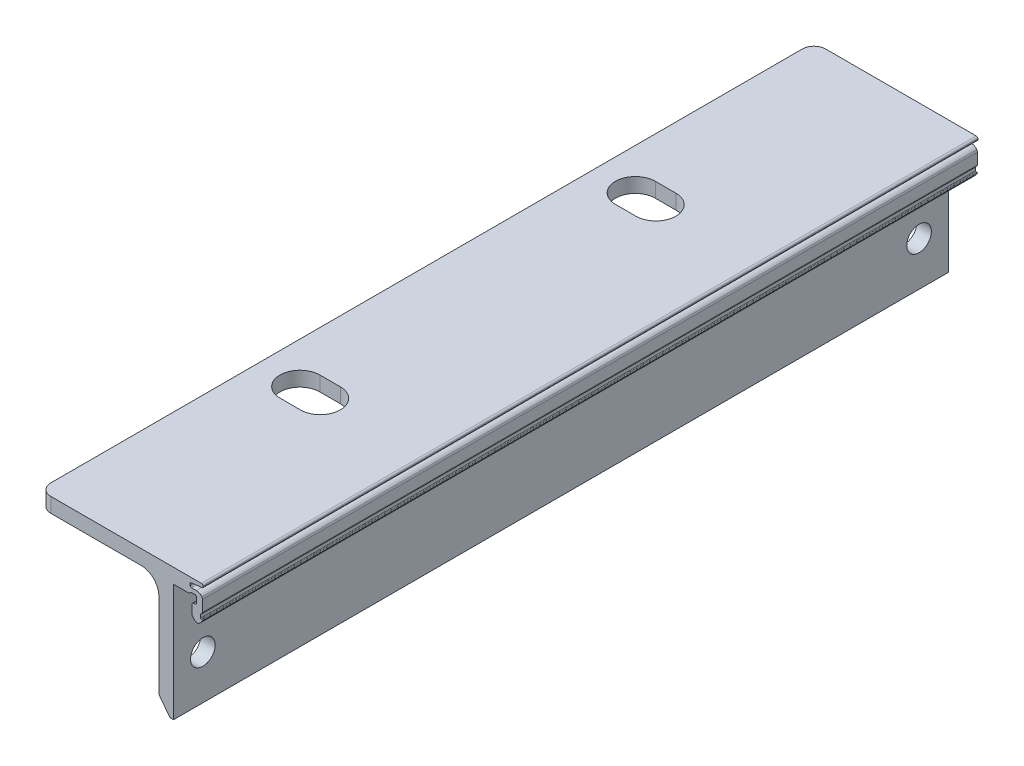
ISO-10303-21;
HEADER;
FILE_DESCRIPTION(('STEP AP214'),'2;1');
FILE_NAME('part.step','',(''),(''),'','','');
FILE_SCHEMA(('AUTOMOTIVE_DESIGN { 1 0 10303 214 1 1 1 1 }'));
ENDSEC;
DATA;
#1=APPLICATION_CONTEXT('core data for automotive mechanical design processes');
#2=APPLICATION_PROTOCOL_DEFINITION('international standard','automotive_design',2000,#1);
#3=PRODUCT_CONTEXT('',#1,'mechanical');
#4=PRODUCT('Part','Part','',(#3));
#5=PRODUCT_RELATED_PRODUCT_CATEGORY('part','',(#4));
#6=PRODUCT_DEFINITION_FORMATION('','',#4);
#7=PRODUCT_DEFINITION_CONTEXT('part definition',#1,'design');
#8=PRODUCT_DEFINITION('design','',#6,#7);
#9=PRODUCT_DEFINITION_SHAPE('','',#8);
#10=(LENGTH_UNIT() NAMED_UNIT(*) SI_UNIT(.MILLI.,.METRE.));
#11=(NAMED_UNIT(*) PLANE_ANGLE_UNIT() SI_UNIT($,.RADIAN.));
#12=(NAMED_UNIT(*) SI_UNIT($,.STERADIAN.) SOLID_ANGLE_UNIT());
#13=UNCERTAINTY_MEASURE_WITH_UNIT(LENGTH_MEASURE(1.E-05),#10,'distance_accuracy_value','');
#14=(GEOMETRIC_REPRESENTATION_CONTEXT(3) GLOBAL_UNCERTAINTY_ASSIGNED_CONTEXT((#13)) GLOBAL_UNIT_ASSIGNED_CONTEXT((#10,
#11,#12)) REPRESENTATION_CONTEXT('',''));
#15=CARTESIAN_POINT('',(0.,0.,0.));
#16=DIRECTION('',(0.,0.,1.));
#17=DIRECTION('',(1.,0.,0.));
#18=AXIS2_PLACEMENT_3D('',#15,#16,#17);
#19=CARTESIAN_POINT('',(2329.98403514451,-3290.10376988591,66.));
#20=DIRECTION('',(0.,-1.,0.));
#21=DIRECTION('',(1.,0.,0.));
#22=AXIS2_PLACEMENT_3D('',#19,#20,#21);
#23=PLANE('',#22);
#24=DIRECTION('',(-1.,0.,0.));
#25=VECTOR('',#24,1.);
#26=CARTESIAN_POINT('',(2340.4840351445,-3290.10376988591,25.1750000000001));
#27=LINE('',#26,#25);
#28=CARTESIAN_POINT('',(2340.4840351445,-3290.10376988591,25.1750000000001));
#29=VERTEX_POINT('',#28);
#30=CARTESIAN_POINT('',(2336.9840351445,-3290.10376988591,25.1750000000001));
#31=VERTEX_POINT('',#30);
#32=EDGE_CURVE('E378',#29,#31,#27,.T.);
#33=ORIENTED_EDGE('',*,*,#32,.F.);
#34=CARTESIAN_POINT('',(2340.4840351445,-3290.10376988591,28.575));
#35=DIRECTION('',(0.,1.,0.));
#36=DIRECTION('',(1.,0.,0.));
#37=AXIS2_PLACEMENT_3D('',#34,#35,#36);
#38=CIRCLE('',#37,3.39999999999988);
#39=CARTESIAN_POINT('',(2340.4840351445,-3290.10376988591,31.9749999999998));
#40=VERTEX_POINT('',#39);
#41=EDGE_CURVE('E383',#40,#29,#38,.T.);
#42=ORIENTED_EDGE('',*,*,#41,.F.);
#43=DIRECTION('',(1.,0.,0.));
#44=VECTOR('',#43,1.);
#45=CARTESIAN_POINT('',(2340.4840351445,-3290.10376988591,31.9749999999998));
#46=LINE('',#45,#44);
#47=CARTESIAN_POINT('',(2336.9840351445,-3290.10376988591,31.9749999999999));
#48=VERTEX_POINT('',#47);
#49=EDGE_CURVE('E387',#48,#40,#46,.T.);
#50=ORIENTED_EDGE('',*,*,#49,.F.);
#51=CARTESIAN_POINT('',(2336.9840351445,-3290.10376988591,28.575));
#52=DIRECTION('',(0.,1.,0.));
#53=DIRECTION('',(1.,0.,0.));
#54=AXIS2_PLACEMENT_3D('',#51,#52,#53);
#55=CIRCLE('',#54,3.39999999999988);
#56=EDGE_CURVE('E367',#31,#48,#55,.T.);
#57=ORIENTED_EDGE('',*,*,#56,.F.);
#58=EDGE_LOOP('',(#33,#42,#50,#57));
#59=FACE_BOUND('',#58,.T.);
#60=DIRECTION('',(1.,0.,0.));
#61=VECTOR('',#60,1.);
#62=CARTESIAN_POINT('',(2340.4840351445,-3290.10376988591,-25.1750000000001));
#63=LINE('',#62,#61);
#64=CARTESIAN_POINT('',(2336.9840351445,-3290.10376988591,-25.1750000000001));
#65=VERTEX_POINT('',#64);
#66=CARTESIAN_POINT('',(2340.4840351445,-3290.10376988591,-25.1750000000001));
#67=VERTEX_POINT('',#66);
#68=EDGE_CURVE('E398',#65,#67,#63,.T.);
#69=ORIENTED_EDGE('',*,*,#68,.F.);
#70=CARTESIAN_POINT('',(2336.9840351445,-3290.10376988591,-28.5749999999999));
#71=DIRECTION('',(0.,1.,0.));
#72=DIRECTION('',(-1.,0.,0.));
#73=AXIS2_PLACEMENT_3D('',#70,#71,#72);
#74=CIRCLE('',#73,3.39999999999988);
#75=CARTESIAN_POINT('',(2336.9840351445,-3290.10376988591,-31.9749999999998));
#76=VERTEX_POINT('',#75);
#77=EDGE_CURVE('E394',#76,#65,#74,.T.);
#78=ORIENTED_EDGE('',*,*,#77,.F.);
#79=DIRECTION('',(-1.,0.,0.));
#80=VECTOR('',#79,1.);
#81=CARTESIAN_POINT('',(2340.4840351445,-3290.10376988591,-31.9749999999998));
#82=LINE('',#81,#80);
#83=CARTESIAN_POINT('',(2340.4840351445,-3290.10376988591,-31.9749999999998));
#84=VERTEX_POINT('',#83);
#85=EDGE_CURVE('E404',#84,#76,#82,.T.);
#86=ORIENTED_EDGE('',*,*,#85,.F.);
#87=CARTESIAN_POINT('',(2340.4840351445,-3290.10376988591,-28.5749999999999));
#88=DIRECTION('',(0.,1.,0.));
#89=DIRECTION('',(-1.,0.,0.));
#90=AXIS2_PLACEMENT_3D('',#87,#88,#89);
#91=CIRCLE('',#90,3.39999999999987);
#92=EDGE_CURVE('E401',#67,#84,#91,.T.);
#93=ORIENTED_EDGE('',*,*,#92,.F.);
#94=EDGE_LOOP('',(#69,#78,#86,#93));
#95=FACE_BOUND('',#94,.T.);
#96=DIRECTION('',(-1.,0.,0.));
#97=VECTOR('',#96,1.);
#98=CARTESIAN_POINT('',(2329.98403514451,-3290.10376988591,-66.));
#99=LINE('',#98,#97);
#100=CARTESIAN_POINT('',(2357.62403514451,-3290.10376988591,-66.));
#101=VERTEX_POINT('',#100);
#102=CARTESIAN_POINT('',(2331.98403514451,-3290.10376988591,-66.));
#103=VERTEX_POINT('',#102);
#104=EDGE_CURVE('E410',#101,#103,#99,.T.);
#105=ORIENTED_EDGE('',*,*,#104,.T.);
#106=CARTESIAN_POINT('',(2331.98403514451,-3290.10376988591,-64.));
#107=DIRECTION('',(0.,-1.,0.));
#108=DIRECTION('',(1.,0.,0.));
#109=AXIS2_PLACEMENT_3D('',#106,#107,#108);
#110=CIRCLE('',#109,2.);
#111=CARTESIAN_POINT('',(2329.98403514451,-3290.10376988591,-64.));
#112=VERTEX_POINT('',#111);
#113=EDGE_CURVE('E44',#103,#112,#110,.F.);
#114=ORIENTED_EDGE('',*,*,#113,.T.);
#115=DIRECTION('',(0.,0.,-1.));
#116=VECTOR('',#115,1.);
#117=CARTESIAN_POINT('',(2329.98403514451,-3290.10376988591,66.));
#118=LINE('',#117,#116);
#119=CARTESIAN_POINT('',(2329.98403514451,-3290.10376988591,64.));
#120=VERTEX_POINT('',#119);
#121=EDGE_CURVE('E688',#120,#112,#118,.T.);
#122=ORIENTED_EDGE('',*,*,#121,.F.);
#123=CARTESIAN_POINT('',(2331.98403514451,-3290.10376988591,64.));
#124=DIRECTION('',(0.,-1.,0.));
#125=DIRECTION('',(1.,0.,0.));
#126=AXIS2_PLACEMENT_3D('',#123,#124,#125);
#127=CIRCLE('',#126,2.);
#128=CARTESIAN_POINT('',(2331.98403514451,-3290.10376988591,66.));
#129=VERTEX_POINT('',#128);
#130=EDGE_CURVE('E51',#120,#129,#127,.F.);
#131=ORIENTED_EDGE('',*,*,#130,.T.);
#132=DIRECTION('',(-1.,0.,0.));
#133=VECTOR('',#132,1.);
#134=CARTESIAN_POINT('',(2355.38403514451,-3290.10376988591,66.));
#135=LINE('',#134,#133);
#136=CARTESIAN_POINT('',(2357.62403514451,-3290.10376988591,66.));
#137=VERTEX_POINT('',#136);
#138=EDGE_CURVE('E417',#137,#129,#135,.T.);
#139=ORIENTED_EDGE('',*,*,#138,.F.);
#140=DIRECTION('',(0.,0.,-1.));
#141=VECTOR('',#140,1.);
#142=CARTESIAN_POINT('',(2357.62403514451,-3290.10376988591,66.));
#143=LINE('',#142,#141);
#144=EDGE_CURVE('E496',#137,#101,#143,.T.);
#145=ORIENTED_EDGE('',*,*,#144,.T.);
#146=EDGE_LOOP('',(#105,#114,#122,#131,#139,#145));
#147=FACE_BOUND('',#146,.T.);
#148=ADVANCED_FACE('F36',(#59,#95,#147),#23,.F.);
#149=CARTESIAN_POINT('',(2329.98403514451,-3290.10376988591,66.));
#150=DIRECTION('',(1.,0.,0.));
#151=DIRECTION('',(0.,0.,-1.));
#152=AXIS2_PLACEMENT_3D('',#149,#150,#151);
#153=PLANE('',#152);
#154=ORIENTED_EDGE('',*,*,#121,.T.);
#155=DIRECTION('',(0.,-1.,0.));
#156=VECTOR('',#155,1.);
#157=CARTESIAN_POINT('',(2329.98403514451,-3292.60376988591,-64.));
#158=LINE('',#157,#156);
#159=CARTESIAN_POINT('',(2329.98403514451,-3292.60376988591,-64.));
#160=VERTEX_POINT('',#159);
#161=EDGE_CURVE('E733',#112,#160,#158,.T.);
#162=ORIENTED_EDGE('',*,*,#161,.T.);
#163=DIRECTION('',(0.,0.,-1.));
#164=VECTOR('',#163,1.);
#165=CARTESIAN_POINT('',(2329.98403514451,-3292.60376988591,66.));
#166=LINE('',#165,#164);
#167=CARTESIAN_POINT('',(2329.98403514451,-3292.60376988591,64.));
#168=VERTEX_POINT('',#167);
#169=EDGE_CURVE('E685',#168,#160,#166,.T.);
#170=ORIENTED_EDGE('',*,*,#169,.F.);
#171=DIRECTION('',(0.,-1.,0.));
#172=VECTOR('',#171,1.);
#173=CARTESIAN_POINT('',(2329.98403514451,-3290.10376988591,64.));
#174=LINE('',#173,#172);
#175=EDGE_CURVE('E723',#168,#120,#174,.F.);
#176=ORIENTED_EDGE('',*,*,#175,.T.);
#177=EDGE_LOOP('',(#154,#162,#170,#176));
#178=FACE_BOUND('',#177,.T.);
#179=ADVANCED_FACE('F745',(#178),#153,.F.);
#180=CARTESIAN_POINT('',(2329.98403514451,-3292.60376988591,66.));
#181=DIRECTION('',(0.,1.,0.));
#182=DIRECTION('',(0.,0.,1.));
#183=AXIS2_PLACEMENT_3D('',#180,#181,#182);
#184=PLANE('',#183);
#185=DIRECTION('',(1.,0.,0.));
#186=VECTOR('',#185,1.);
#187=CARTESIAN_POINT('',(2329.98403514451,-3292.60376988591,31.9749999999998));
#188=LINE('',#187,#186);
#189=CARTESIAN_POINT('',(2336.9840351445,-3292.60376988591,31.9749999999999));
#190=VERTEX_POINT('',#189);
#191=CARTESIAN_POINT('',(2340.4840351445,-3292.60376988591,31.9749999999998));
#192=VERTEX_POINT('',#191);
#193=EDGE_CURVE('E717',#190,#192,#188,.T.);
#194=ORIENTED_EDGE('',*,*,#193,.T.);
#195=CARTESIAN_POINT('',(2340.4840351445,-3292.60376988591,28.575));
#196=DIRECTION('',(0.,1.,0.));
#197=DIRECTION('',(0.,0.,1.));
#198=AXIS2_PLACEMENT_3D('',#195,#196,#197);
#199=CIRCLE('',#198,3.39999999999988);
#200=CARTESIAN_POINT('',(2340.4840351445,-3292.60376988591,25.1750000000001));
#201=VERTEX_POINT('',#200);
#202=EDGE_CURVE('E720',#192,#201,#199,.T.);
#203=ORIENTED_EDGE('',*,*,#202,.T.);
#204=DIRECTION('',(-1.,0.,0.));
#205=VECTOR('',#204,1.);
#206=CARTESIAN_POINT('',(2329.98403514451,-3292.60376988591,25.1750000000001));
#207=LINE('',#206,#205);
#208=CARTESIAN_POINT('',(2336.9840351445,-3292.60376988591,25.1750000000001));
#209=VERTEX_POINT('',#208);
#210=EDGE_CURVE('E714',#201,#209,#207,.T.);
#211=ORIENTED_EDGE('',*,*,#210,.T.);
#212=CARTESIAN_POINT('',(2336.9840351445,-3292.60376988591,28.575));
#213=DIRECTION('',(0.,1.,0.));
#214=DIRECTION('',(0.,0.,1.));
#215=AXIS2_PLACEMENT_3D('',#212,#213,#214);
#216=CIRCLE('',#215,3.39999999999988);
#217=EDGE_CURVE('E370',#209,#190,#216,.T.);
#218=ORIENTED_EDGE('',*,*,#217,.T.);
#219=EDGE_LOOP('',(#194,#203,#211,#218));
#220=FACE_BOUND('',#219,.T.);
#221=DIRECTION('',(-1.,0.,0.));
#222=VECTOR('',#221,1.);
#223=CARTESIAN_POINT('',(2329.98403514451,-3292.60376988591,-31.9749999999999));
#224=LINE('',#223,#222);
#225=CARTESIAN_POINT('',(2340.4840351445,-3292.60376988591,-31.9749999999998));
#226=VERTEX_POINT('',#225);
#227=CARTESIAN_POINT('',(2336.9840351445,-3292.60376988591,-31.9749999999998));
#228=VERTEX_POINT('',#227);
#229=EDGE_CURVE('E708',#226,#228,#224,.T.);
#230=ORIENTED_EDGE('',*,*,#229,.T.);
#231=CARTESIAN_POINT('',(2336.9840351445,-3292.60376988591,-28.5749999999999));
#232=DIRECTION('',(0.,1.,0.));
#233=DIRECTION('',(0.,0.,1.));
#234=AXIS2_PLACEMENT_3D('',#231,#232,#233);
#235=CIRCLE('',#234,3.39999999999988);
#236=CARTESIAN_POINT('',(2336.9840351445,-3292.60376988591,-25.1750000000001));
#237=VERTEX_POINT('',#236);
#238=EDGE_CURVE('E711',#228,#237,#235,.T.);
#239=ORIENTED_EDGE('',*,*,#238,.T.);
#240=DIRECTION('',(1.,0.,0.));
#241=VECTOR('',#240,1.);
#242=CARTESIAN_POINT('',(2329.98403514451,-3292.60376988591,-25.1750000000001));
#243=LINE('',#242,#241);
#244=CARTESIAN_POINT('',(2340.4840351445,-3292.60376988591,-25.1750000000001));
#245=VERTEX_POINT('',#244);
#246=EDGE_CURVE('E702',#237,#245,#243,.T.);
#247=ORIENTED_EDGE('',*,*,#246,.T.);
#248=CARTESIAN_POINT('',(2340.4840351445,-3292.60376988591,-28.5749999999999));
#249=DIRECTION('',(0.,1.,0.));
#250=DIRECTION('',(0.,0.,1.));
#251=AXIS2_PLACEMENT_3D('',#248,#249,#250);
#252=CIRCLE('',#251,3.39999999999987);
#253=EDGE_CURVE('E705',#245,#226,#252,.T.);
#254=ORIENTED_EDGE('',*,*,#253,.T.);
#255=EDGE_LOOP('',(#230,#239,#247,#254));
#256=FACE_BOUND('',#255,.T.);
#257=ORIENTED_EDGE('',*,*,#169,.T.);
#258=CARTESIAN_POINT('',(2331.98403514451,-3292.60376988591,-64.));
#259=DIRECTION('',(0.,1.,0.));
#260=DIRECTION('',(0.,0.,1.));
#261=AXIS2_PLACEMENT_3D('',#258,#259,#260);
#262=CIRCLE('',#261,2.);
#263=CARTESIAN_POINT('',(2331.98403514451,-3292.60376988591,-66.));
#264=VERTEX_POINT('',#263);
#265=EDGE_CURVE('E738',#160,#264,#262,.F.);
#266=ORIENTED_EDGE('',*,*,#265,.T.);
#267=DIRECTION('',(1.,0.,0.));
#268=VECTOR('',#267,1.);
#269=CARTESIAN_POINT('',(2329.98403514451,-3292.60376988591,-66.));
#270=LINE('',#269,#268);
#271=CARTESIAN_POINT('',(2347.3840351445,-3292.60376988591,-66.));
#272=VERTEX_POINT('',#271);
#273=EDGE_CURVE('E498',#264,#272,#270,.T.);
#274=ORIENTED_EDGE('',*,*,#273,.T.);
#275=DIRECTION('',(0.,0.,-1.));
#276=VECTOR('',#275,1.);
#277=CARTESIAN_POINT('',(2347.3840351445,-3292.60376988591,66.));
#278=LINE('',#277,#276);
#279=CARTESIAN_POINT('',(2347.3840351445,-3292.60376988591,66.));
#280=VERTEX_POINT('',#279);
#281=EDGE_CURVE('E694',#272,#280,#278,.F.);
#282=ORIENTED_EDGE('',*,*,#281,.T.);
#283=DIRECTION('',(1.,0.,0.));
#284=VECTOR('',#283,1.);
#285=CARTESIAN_POINT('',(2329.98403514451,-3292.60376988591,66.));
#286=LINE('',#285,#284);
#287=CARTESIAN_POINT('',(2331.98403514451,-3292.60376988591,66.));
#288=VERTEX_POINT('',#287);
#289=EDGE_CURVE('E419',#288,#280,#286,.T.);
#290=ORIENTED_EDGE('',*,*,#289,.F.);
#291=CARTESIAN_POINT('',(2331.98403514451,-3292.60376988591,64.));
#292=DIRECTION('',(0.,1.,0.));
#293=DIRECTION('',(0.,0.,1.));
#294=AXIS2_PLACEMENT_3D('',#291,#292,#293);
#295=CIRCLE('',#294,2.);
#296=EDGE_CURVE('E736',#288,#168,#295,.F.);
#297=ORIENTED_EDGE('',*,*,#296,.T.);
#298=EDGE_LOOP('',(#257,#266,#274,#282,#290,#297));
#299=FACE_BOUND('',#298,.T.);
#300=ADVANCED_FACE('F750',(#220,#256,#299),#184,.F.);
#301=CARTESIAN_POINT('',(2350.3840351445,-3292.60376988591,66.));
#302=DIRECTION('',(1.,0.,0.));
#303=DIRECTION('',(0.,0.,-1.));
#304=AXIS2_PLACEMENT_3D('',#301,#302,#303);
#305=PLANE('',#304);
#306=CARTESIAN_POINT('',(2350.38403514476,-3305.10376988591,61.));
#307=DIRECTION('',(-1.,0.,0.));
#308=DIRECTION('',(0.,1.,0.));
#309=AXIS2_PLACEMENT_3D('',#306,#307,#308);
#310=CIRCLE('',#309,2.09999999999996);
#311=CARTESIAN_POINT('',(2350.38403514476,-3303.00376988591,61.));
#312=VERTEX_POINT('',#311);
#313=EDGE_CURVE('E731',#312,#312,#310,.T.);
#314=ORIENTED_EDGE('',*,*,#313,.F.);
#315=EDGE_LOOP('',(#314));
#316=FACE_BOUND('',#315,.T.);
#317=CARTESIAN_POINT('',(2350.38403514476,-3305.10376988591,-61.));
#318=DIRECTION('',(-1.,0.,0.));
#319=DIRECTION('',(0.,-1.,0.));
#320=AXIS2_PLACEMENT_3D('',#317,#318,#319);
#321=CIRCLE('',#320,2.09999999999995);
#322=CARTESIAN_POINT('',(2350.38403514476,-3307.20376988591,-61.));
#323=VERTEX_POINT('',#322);
#324=EDGE_CURVE('E727',#323,#323,#321,.T.);
#325=ORIENTED_EDGE('',*,*,#324,.F.);
#326=EDGE_LOOP('',(#325));
#327=FACE_BOUND('',#326,.T.);
#328=DIRECTION('',(0.,-1.,0.));
#329=VECTOR('',#328,1.);
#330=CARTESIAN_POINT('',(2350.3840351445,-3292.60376988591,66.));
#331=LINE('',#330,#329);
#332=CARTESIAN_POINT('',(2350.3840351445,-3295.60376988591,66.));
#333=VERTEX_POINT('',#332);
#334=CARTESIAN_POINT('',(2350.3840351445,-3310.10376988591,66.));
#335=VERTEX_POINT('',#334);
#336=EDGE_CURVE('E422',#333,#335,#331,.T.);
#337=ORIENTED_EDGE('',*,*,#336,.F.);
#338=DIRECTION('',(0.,0.,-1.));
#339=VECTOR('',#338,1.);
#340=CARTESIAN_POINT('',(2350.3840351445,-3295.60376988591,-66.));
#341=LINE('',#340,#339);
#342=CARTESIAN_POINT('',(2350.3840351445,-3295.60376988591,-66.));
#343=VERTEX_POINT('',#342);
#344=EDGE_CURVE('E691',#333,#343,#341,.T.);
#345=ORIENTED_EDGE('',*,*,#344,.T.);
#346=DIRECTION('',(0.,-1.,0.));
#347=VECTOR('',#346,1.);
#348=CARTESIAN_POINT('',(2350.3840351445,-3292.60376988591,-66.));
#349=LINE('',#348,#347);
#350=CARTESIAN_POINT('',(2350.3840351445,-3310.10376988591,-66.));
#351=VERTEX_POINT('',#350);
#352=EDGE_CURVE('E500',#343,#351,#349,.T.);
#353=ORIENTED_EDGE('',*,*,#352,.T.);
#354=DIRECTION('',(0.,0.,-1.));
#355=VECTOR('',#354,1.);
#356=CARTESIAN_POINT('',(2350.3840351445,-3310.10376988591,66.));
#357=LINE('',#356,#355);
#358=EDGE_CURVE('E682',#335,#351,#357,.T.);
#359=ORIENTED_EDGE('',*,*,#358,.F.);
#360=EDGE_LOOP('',(#337,#345,#353,#359));
#361=FACE_BOUND('',#360,.T.);
#362=ADVANCED_FACE('F936',(#316,#327,#361),#305,.F.);
#363=CARTESIAN_POINT('',(2350.3840351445,-3310.10376988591,66.));
#364=DIRECTION('',(0.796162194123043,0.605083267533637,0.));
#365=DIRECTION('',(-0.605083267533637,0.796162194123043,0.));
#366=AXIS2_PLACEMENT_3D('',#363,#364,#365);
#367=PLANE('',#366);
#368=DIRECTION('',(0.605083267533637,-0.796162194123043,0.));
#369=VECTOR('',#368,1.);
#370=CARTESIAN_POINT('',(2350.3840351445,-3310.10376988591,-66.));
#371=LINE('',#370,#369);
#372=CARTESIAN_POINT('',(2352.2840351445,-3312.60376988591,-66.));
#373=VERTEX_POINT('',#372);
#374=EDGE_CURVE('E502',#351,#373,#371,.T.);
#375=ORIENTED_EDGE('',*,*,#374,.T.);
#376=DIRECTION('',(0.,0.,-1.));
#377=VECTOR('',#376,1.);
#378=CARTESIAN_POINT('',(2352.2840351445,-3312.60376988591,66.));
#379=LINE('',#378,#377);
#380=CARTESIAN_POINT('',(2352.2840351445,-3312.60376988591,66.));
#381=VERTEX_POINT('',#380);
#382=EDGE_CURVE('E679',#381,#373,#379,.T.);
#383=ORIENTED_EDGE('',*,*,#382,.F.);
#384=DIRECTION('',(0.605083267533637,-0.796162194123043,0.));
#385=VECTOR('',#384,1.);
#386=CARTESIAN_POINT('',(2350.3840351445,-3310.10376988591,66.));
#387=LINE('',#386,#385);
#388=EDGE_CURVE('E424',#335,#381,#387,.T.);
#389=ORIENTED_EDGE('',*,*,#388,.F.);
#390=ORIENTED_EDGE('',*,*,#358,.T.);
#391=EDGE_LOOP('',(#375,#383,#389,#390));
#392=FACE_BOUND('',#391,.T.);
#393=ADVANCED_FACE('F932',(#392),#367,.F.);
#394=CARTESIAN_POINT('',(2352.8840351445,-3312.60376988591,66.));
#395=DIRECTION('',(0.,1.,0.));
#396=DIRECTION('',(0.,0.,1.));
#397=AXIS2_PLACEMENT_3D('',#394,#395,#396);
#398=PLANE('',#397);
#399=DIRECTION('',(1.,0.,0.));
#400=VECTOR('',#399,1.);
#401=CARTESIAN_POINT('',(2352.8840351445,-3312.60376988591,-66.));
#402=LINE('',#401,#400);
#403=CARTESIAN_POINT('',(2352.8840351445,-3312.60376988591,-66.));
#404=VERTEX_POINT('',#403);
#405=EDGE_CURVE('E504',#373,#404,#402,.T.);
#406=ORIENTED_EDGE('',*,*,#405,.T.);
#407=DIRECTION('',(0.,0.,-1.));
#408=VECTOR('',#407,1.);
#409=CARTESIAN_POINT('',(2352.8840351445,-3312.60376988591,66.));
#410=LINE('',#409,#408);
#411=CARTESIAN_POINT('',(2352.8840351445,-3312.60376988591,66.));
#412=VERTEX_POINT('',#411);
#413=EDGE_CURVE('E676',#412,#404,#410,.T.);
#414=ORIENTED_EDGE('',*,*,#413,.F.);
#415=DIRECTION('',(1.,0.,0.));
#416=VECTOR('',#415,1.);
#417=CARTESIAN_POINT('',(2352.8840351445,-3312.60376988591,66.));
#418=LINE('',#417,#416);
#419=EDGE_CURVE('E426',#381,#412,#418,.T.);
#420=ORIENTED_EDGE('',*,*,#419,.F.);
#421=ORIENTED_EDGE('',*,*,#382,.T.);
#422=EDGE_LOOP('',(#406,#414,#420,#421));
#423=FACE_BOUND('',#422,.T.);
#424=ADVANCED_FACE('F928',(#423),#398,.F.);
#425=CARTESIAN_POINT('',(2352.88403514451,-3292.60376988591,66.));
#426=DIRECTION('',(-1.,0.,0.));
#427=DIRECTION('',(0.,-1.,0.));
#428=AXIS2_PLACEMENT_3D('',#425,#426,#427);
#429=PLANE('',#428);
#430=CARTESIAN_POINT('',(2352.88403514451,-3305.10376988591,61.));
#431=DIRECTION('',(-1.,0.,0.));
#432=DIRECTION('',(0.,-1.,0.));
#433=AXIS2_PLACEMENT_3D('',#430,#431,#432);
#434=CIRCLE('',#433,2.09999999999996);
#435=CARTESIAN_POINT('',(2352.88403514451,-3307.20376988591,61.));
#436=VERTEX_POINT('',#435);
#437=EDGE_CURVE('E728',#436,#436,#434,.T.);
#438=ORIENTED_EDGE('',*,*,#437,.T.);
#439=EDGE_LOOP('',(#438));
#440=FACE_BOUND('',#439,.T.);
#441=CARTESIAN_POINT('',(2352.88403514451,-3305.10376988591,-61.));
#442=DIRECTION('',(-1.,0.,0.));
#443=DIRECTION('',(0.,-1.,0.));
#444=AXIS2_PLACEMENT_3D('',#441,#442,#443);
#445=CIRCLE('',#444,2.09999999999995);
#446=CARTESIAN_POINT('',(2352.88403514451,-3307.20376988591,-61.));
#447=VERTEX_POINT('',#446);
#448=EDGE_CURVE('E724',#447,#447,#445,.T.);
#449=ORIENTED_EDGE('',*,*,#448,.T.);
#450=EDGE_LOOP('',(#449));
#451=FACE_BOUND('',#450,.T.);
#452=DIRECTION('',(0.,1.,0.));
#453=VECTOR('',#452,1.);
#454=CARTESIAN_POINT('',(2352.88403514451,-3292.60376988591,-66.));
#455=LINE('',#454,#453);
#456=CARTESIAN_POINT('',(2352.88403514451,-3292.60376988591,-66.));
#457=VERTEX_POINT('',#456);
#458=EDGE_CURVE('E506',#404,#457,#455,.T.);
#459=ORIENTED_EDGE('',*,*,#458,.T.);
#460=DIRECTION('',(0.,0.,-1.));
#461=VECTOR('',#460,1.);
#462=CARTESIAN_POINT('',(2352.88403514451,-3292.60376988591,66.));
#463=LINE('',#462,#461);
#464=CARTESIAN_POINT('',(2352.88403514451,-3292.60376988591,66.));
#465=VERTEX_POINT('',#464);
#466=EDGE_CURVE('E673',#465,#457,#463,.T.);
#467=ORIENTED_EDGE('',*,*,#466,.F.);
#468=DIRECTION('',(0.,1.,0.));
#469=VECTOR('',#468,1.);
#470=CARTESIAN_POINT('',(2352.88403514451,-3292.60376988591,66.));
#471=LINE('',#470,#469);
#472=EDGE_CURVE('E428',#412,#465,#471,.T.);
#473=ORIENTED_EDGE('',*,*,#472,.F.);
#474=ORIENTED_EDGE('',*,*,#413,.T.);
#475=EDGE_LOOP('',(#459,#467,#473,#474));
#476=FACE_BOUND('',#475,.T.);
#477=ADVANCED_FACE('F924',(#440,#451,#476),#429,.F.);
#478=CARTESIAN_POINT('',(2355.38403514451,-3292.60376988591,66.));
#479=DIRECTION('',(0.,1.,0.));
#480=DIRECTION('',(0.,0.,1.));
#481=AXIS2_PLACEMENT_3D('',#478,#479,#480);
#482=PLANE('',#481);
#483=DIRECTION('',(1.,0.,0.));
#484=VECTOR('',#483,1.);
#485=CARTESIAN_POINT('',(2355.38403514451,-3292.60376988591,-66.));
#486=LINE('',#485,#484);
#487=CARTESIAN_POINT('',(2355.46834905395,-3292.60376988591,-66.));
#488=VERTEX_POINT('',#487);
#489=EDGE_CURVE('E509',#457,#488,#486,.T.);
#490=ORIENTED_EDGE('',*,*,#489,.T.);
#491=DIRECTION('',(0.,0.,-1.));
#492=VECTOR('',#491,1.);
#493=CARTESIAN_POINT('',(2355.46834905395,-3292.60376988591,66.));
#494=LINE('',#493,#492);
#495=CARTESIAN_POINT('',(2355.46834905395,-3292.60376988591,66.));
#496=VERTEX_POINT('',#495);
#497=EDGE_CURVE('E670',#496,#488,#494,.T.);
#498=ORIENTED_EDGE('',*,*,#497,.F.);
#499=DIRECTION('',(1.,-3.55271367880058E-13,0.));
#500=VECTOR('',#499,1.);
#501=CARTESIAN_POINT('',(2352.88403514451,-3292.60376988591,66.));
#502=LINE('',#501,#500);
#503=EDGE_CURVE('E430',#465,#496,#502,.T.);
#504=ORIENTED_EDGE('',*,*,#503,.F.);
#505=ORIENTED_EDGE('',*,*,#466,.T.);
#506=EDGE_LOOP('',(#490,#498,#504,#505));
#507=FACE_BOUND('',#506,.T.);
#508=ADVANCED_FACE('F920',(#507),#482,.F.);
#509=CARTESIAN_POINT('',(2355.46834905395,-3292.30376988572,66.));
#510=DIRECTION('',(0.,0.,-1.));
#511=DIRECTION('',(-1.,0.,0.));
#512=AXIS2_PLACEMENT_3D('',#509,#510,#511);
#513=CYLINDRICAL_SURFACE('',#512,0.300000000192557);
#514=CARTESIAN_POINT('',(2355.46834905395,-3292.30376988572,-66.));
#515=DIRECTION('',(0.,0.,1.));
#516=DIRECTION('',(-1.,0.,0.));
#517=AXIS2_PLACEMENT_3D('',#514,#515,#516);
#518=CIRCLE('',#517,0.300000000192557);
#519=CARTESIAN_POINT('',(2355.72815667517,-3292.45376988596,-66.));
#520=VERTEX_POINT('',#519);
#521=EDGE_CURVE('E511',#488,#520,#518,.T.);
#522=ORIENTED_EDGE('',*,*,#521,.T.);
#523=DIRECTION('',(0.,0.,-1.));
#524=VECTOR('',#523,1.);
#525=CARTESIAN_POINT('',(2355.72815667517,-3292.45376988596,66.));
#526=LINE('',#525,#524);
#527=CARTESIAN_POINT('',(2355.72815667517,-3292.45376988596,66.));
#528=VERTEX_POINT('',#527);
#529=EDGE_CURVE('E667',#528,#520,#526,.T.);
#530=ORIENTED_EDGE('',*,*,#529,.F.);
#531=CARTESIAN_POINT('',(2355.46834905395,-3292.30376988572,66.));
#532=DIRECTION('',(0.,0.,1.));
#533=DIRECTION('',(-1.,0.,0.));
#534=AXIS2_PLACEMENT_3D('',#531,#532,#533);
#535=CIRCLE('',#534,0.300000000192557);
#536=EDGE_CURVE('E432',#496,#528,#535,.T.);
#537=ORIENTED_EDGE('',*,*,#536,.F.);
#538=ORIENTED_EDGE('',*,*,#497,.T.);
#539=EDGE_LOOP('',(#522,#530,#537,#538));
#540=FACE_BOUND('',#539,.T.);
#541=ADVANCED_FACE('F916',(#540),#513,.T.);
#542=CARTESIAN_POINT('',(2355.9879642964,-3292.60376988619,66.));
#543=DIRECTION('',(0.,0.,-1.));
#544=DIRECTION('',(-1.,0.,0.));
#545=AXIS2_PLACEMENT_3D('',#542,#543,#544);
#546=CYLINDRICAL_SURFACE('',#545,0.300000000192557);
#547=CARTESIAN_POINT('',(2355.9879642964,-3292.60376988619,-66.));
#548=DIRECTION('',(0.,0.,-1.));
#549=DIRECTION('',(-1.,0.,0.));
#550=AXIS2_PLACEMENT_3D('',#547,#548,#549);
#551=CIRCLE('',#550,0.300000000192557);
#552=CARTESIAN_POINT('',(2355.9879642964,-3292.303769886,-66.));
#553=VERTEX_POINT('',#552);
#554=EDGE_CURVE('E513',#520,#553,#551,.T.);
#555=ORIENTED_EDGE('',*,*,#554,.T.);
#556=DIRECTION('',(0.,0.,-1.));
#557=VECTOR('',#556,1.);
#558=CARTESIAN_POINT('',(2355.9879642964,-3292.303769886,66.));
#559=LINE('',#558,#557);
#560=CARTESIAN_POINT('',(2355.9879642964,-3292.303769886,66.));
#561=VERTEX_POINT('',#560);
#562=EDGE_CURVE('E664',#561,#553,#559,.T.);
#563=ORIENTED_EDGE('',*,*,#562,.F.);
#564=CARTESIAN_POINT('',(2355.9879642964,-3292.60376988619,66.));
#565=DIRECTION('',(0.,0.,-1.));
#566=DIRECTION('',(-1.,0.,0.));
#567=AXIS2_PLACEMENT_3D('',#564,#565,#566);
#568=CIRCLE('',#567,0.300000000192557);
#569=EDGE_CURVE('E434',#528,#561,#568,.T.);
#570=ORIENTED_EDGE('',*,*,#569,.F.);
#571=ORIENTED_EDGE('',*,*,#529,.T.);
#572=EDGE_LOOP('',(#555,#563,#570,#571));
#573=FACE_BOUND('',#572,.T.);
#574=ADVANCED_FACE('F912',(#573),#546,.F.);
#575=CARTESIAN_POINT('',(2356.52403514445,-3292.303769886,66.));
#576=DIRECTION('',(0.,1.,0.));
#577=DIRECTION('',(0.,0.,1.));
#578=AXIS2_PLACEMENT_3D('',#575,#576,#577);
#579=PLANE('',#578);
#580=DIRECTION('',(1.,0.,0.));
#581=VECTOR('',#580,1.);
#582=CARTESIAN_POINT('',(2356.52403514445,-3292.303769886,-66.));
#583=LINE('',#582,#581);
#584=CARTESIAN_POINT('',(2356.52403514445,-3292.303769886,-66.));
#585=VERTEX_POINT('',#584);
#586=EDGE_CURVE('E515',#553,#585,#583,.T.);
#587=ORIENTED_EDGE('',*,*,#586,.T.);
#588=DIRECTION('',(0.,0.,-1.));
#589=VECTOR('',#588,1.);
#590=CARTESIAN_POINT('',(2356.52403514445,-3292.303769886,66.));
#591=LINE('',#590,#589);
#592=CARTESIAN_POINT('',(2356.52403514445,-3292.303769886,66.));
#593=VERTEX_POINT('',#592);
#594=EDGE_CURVE('E661',#593,#585,#591,.T.);
#595=ORIENTED_EDGE('',*,*,#594,.F.);
#596=DIRECTION('',(1.,0.,0.));
#597=VECTOR('',#596,1.);
#598=CARTESIAN_POINT('',(2356.52403514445,-3292.303769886,66.));
#599=LINE('',#598,#597);
#600=EDGE_CURVE('E436',#561,#593,#599,.T.);
#601=ORIENTED_EDGE('',*,*,#600,.F.);
#602=ORIENTED_EDGE('',*,*,#562,.T.);
#603=EDGE_LOOP('',(#587,#595,#601,#602));
#604=FACE_BOUND('',#603,.T.);
#605=ADVANCED_FACE('F908',(#604),#579,.F.);
#606=CARTESIAN_POINT('',(2356.52403514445,-3292.603769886,66.));
#607=DIRECTION('',(0.,0.,-1.));
#608=DIRECTION('',(-1.,0.,0.));
#609=AXIS2_PLACEMENT_3D('',#606,#607,#608);
#610=CYLINDRICAL_SURFACE('',#609,0.300000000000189);
#611=CARTESIAN_POINT('',(2356.52403514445,-3292.603769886,-66.));
#612=DIRECTION('',(0.,0.,-1.));
#613=DIRECTION('',(-1.,0.,0.));
#614=AXIS2_PLACEMENT_3D('',#611,#612,#613);
#615=CIRCLE('',#614,0.300000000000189);
#616=CARTESIAN_POINT('',(2356.82403514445,-3292.603769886,-66.));
#617=VERTEX_POINT('',#616);
#618=EDGE_CURVE('E517',#585,#617,#615,.T.);
#619=ORIENTED_EDGE('',*,*,#618,.T.);
#620=DIRECTION('',(0.,0.,-1.));
#621=VECTOR('',#620,1.);
#622=CARTESIAN_POINT('',(2356.82403514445,-3292.603769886,66.));
#623=LINE('',#622,#621);
#624=CARTESIAN_POINT('',(2356.82403514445,-3292.603769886,66.));
#625=VERTEX_POINT('',#624);
#626=EDGE_CURVE('E658',#625,#617,#623,.T.);
#627=ORIENTED_EDGE('',*,*,#626,.F.);
#628=CARTESIAN_POINT('',(2356.52403514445,-3292.603769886,66.));
#629=DIRECTION('',(0.,0.,-1.));
#630=DIRECTION('',(-1.,0.,0.));
#631=AXIS2_PLACEMENT_3D('',#628,#629,#630);
#632=CIRCLE('',#631,0.300000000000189);
#633=EDGE_CURVE('E438',#593,#625,#632,.T.);
#634=ORIENTED_EDGE('',*,*,#633,.F.);
#635=ORIENTED_EDGE('',*,*,#594,.T.);
#636=EDGE_LOOP('',(#619,#627,#634,#635));
#637=FACE_BOUND('',#636,.T.);
#638=ADVANCED_FACE('F904',(#637),#610,.F.);
#639=CARTESIAN_POINT('',(2356.82403514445,-3293.40376988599,66.));
#640=DIRECTION('',(1.,0.,0.));
#641=DIRECTION('',(0.,0.,-1.));
#642=AXIS2_PLACEMENT_3D('',#639,#640,#641);
#643=PLANE('',#642);
#644=DIRECTION('',(0.,-1.,0.));
#645=VECTOR('',#644,1.);
#646=CARTESIAN_POINT('',(2356.82403514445,-3293.40376988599,-66.));
#647=LINE('',#646,#645);
#648=CARTESIAN_POINT('',(2356.82403514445,-3293.40376988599,-66.));
#649=VERTEX_POINT('',#648);
#650=EDGE_CURVE('E519',#617,#649,#647,.T.);
#651=ORIENTED_EDGE('',*,*,#650,.T.);
#652=DIRECTION('',(0.,0.,-1.));
#653=VECTOR('',#652,1.);
#654=CARTESIAN_POINT('',(2356.82403514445,-3293.40376988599,66.));
#655=LINE('',#654,#653);
#656=CARTESIAN_POINT('',(2356.82403514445,-3293.40376988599,66.));
#657=VERTEX_POINT('',#656);
#658=EDGE_CURVE('E655',#657,#649,#655,.T.);
#659=ORIENTED_EDGE('',*,*,#658,.F.);
#660=DIRECTION('',(0.,-1.,0.));
#661=VECTOR('',#660,1.);
#662=CARTESIAN_POINT('',(2356.82403514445,-3293.40376988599,66.));
#663=LINE('',#662,#661);
#664=EDGE_CURVE('E440',#625,#657,#663,.T.);
#665=ORIENTED_EDGE('',*,*,#664,.F.);
#666=ORIENTED_EDGE('',*,*,#626,.T.);
#667=EDGE_LOOP('',(#651,#659,#665,#666));
#668=FACE_BOUND('',#667,.T.);
#669=ADVANCED_FACE('F900',(#668),#643,.F.);
#670=CARTESIAN_POINT('',(2356.52403514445,-3293.40376988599,66.));
#671=DIRECTION('',(0.,0.,-1.));
#672=DIRECTION('',(-1.,0.,0.));
#673=AXIS2_PLACEMENT_3D('',#670,#671,#672);
#674=CYLINDRICAL_SURFACE('',#673,0.300000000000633);
#675=CARTESIAN_POINT('',(2356.52403514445,-3293.40376988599,-66.));
#676=DIRECTION('',(0.,0.,-1.));
#677=DIRECTION('',(-1.,0.,0.));
#678=AXIS2_PLACEMENT_3D('',#675,#676,#677);
#679=CIRCLE('',#678,0.300000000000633);
#680=CARTESIAN_POINT('',(2356.52403514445,-3293.70376988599,-66.));
#681=VERTEX_POINT('',#680);
#682=EDGE_CURVE('E521',#649,#681,#679,.T.);
#683=ORIENTED_EDGE('',*,*,#682,.T.);
#684=DIRECTION('',(0.,0.,-1.));
#685=VECTOR('',#684,1.);
#686=CARTESIAN_POINT('',(2356.52403514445,-3293.70376988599,66.));
#687=LINE('',#686,#685);
#688=CARTESIAN_POINT('',(2356.52403514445,-3293.70376988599,66.));
#689=VERTEX_POINT('',#688);
#690=EDGE_CURVE('E652',#689,#681,#687,.T.);
#691=ORIENTED_EDGE('',*,*,#690,.F.);
#692=CARTESIAN_POINT('',(2356.52403514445,-3293.40376988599,66.));
#693=DIRECTION('',(0.,0.,-1.));
#694=DIRECTION('',(-1.,0.,0.));
#695=AXIS2_PLACEMENT_3D('',#692,#693,#694);
#696=CIRCLE('',#695,0.300000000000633);
#697=EDGE_CURVE('E442',#657,#689,#696,.T.);
#698=ORIENTED_EDGE('',*,*,#697,.F.);
#699=ORIENTED_EDGE('',*,*,#658,.T.);
#700=EDGE_LOOP('',(#683,#691,#698,#699));
#701=FACE_BOUND('',#700,.T.);
#702=ADVANCED_FACE('F896',(#701),#674,.F.);
#703=CARTESIAN_POINT('',(2356.32403514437,-3293.70376988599,66.));
#704=DIRECTION('',(0.,-1.,0.));
#705=DIRECTION('',(0.,0.,-1.));
#706=AXIS2_PLACEMENT_3D('',#703,#704,#705);
#707=PLANE('',#706);
#708=DIRECTION('',(-1.,0.,0.));
#709=VECTOR('',#708,1.);
#710=CARTESIAN_POINT('',(2356.32403514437,-3293.70376988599,-66.));
#711=LINE('',#710,#709);
#712=CARTESIAN_POINT('',(2356.32403514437,-3293.70376988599,-66.));
#713=VERTEX_POINT('',#712);
#714=EDGE_CURVE('E523',#681,#713,#711,.T.);
#715=ORIENTED_EDGE('',*,*,#714,.T.);
#716=DIRECTION('',(0.,0.,-1.));
#717=VECTOR('',#716,1.);
#718=CARTESIAN_POINT('',(2356.32403514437,-3293.70376988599,66.));
#719=LINE('',#718,#717);
#720=CARTESIAN_POINT('',(2356.32403514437,-3293.70376988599,66.));
#721=VERTEX_POINT('',#720);
#722=EDGE_CURVE('E649',#721,#713,#719,.T.);
#723=ORIENTED_EDGE('',*,*,#722,.F.);
#724=DIRECTION('',(-1.,0.,0.));
#725=VECTOR('',#724,1.);
#726=CARTESIAN_POINT('',(2356.32403514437,-3293.70376988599,66.));
#727=LINE('',#726,#725);
#728=EDGE_CURVE('E444',#689,#721,#727,.T.);
#729=ORIENTED_EDGE('',*,*,#728,.F.);
#730=ORIENTED_EDGE('',*,*,#690,.T.);
#731=EDGE_LOOP('',(#715,#723,#729,#730));
#732=FACE_BOUND('',#731,.T.);
#733=ADVANCED_FACE('F892',(#732),#707,.F.);
#734=CARTESIAN_POINT('',(2356.32403514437,-3294.003769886,66.));
#735=DIRECTION('',(0.,0.,-1.));
#736=DIRECTION('',(-1.,0.,0.));
#737=AXIS2_PLACEMENT_3D('',#734,#735,#736);
#738=CYLINDRICAL_SURFACE('',#737,0.300000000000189);
#739=CARTESIAN_POINT('',(2356.32403514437,-3294.003769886,-66.));
#740=DIRECTION('',(0.,0.,1.));
#741=DIRECTION('',(-1.,0.,0.));
#742=AXIS2_PLACEMENT_3D('',#739,#740,#741);
#743=CIRCLE('',#742,0.300000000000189);
#744=CARTESIAN_POINT('',(2356.02403514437,-3294.003769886,-66.));
#745=VERTEX_POINT('',#744);
#746=EDGE_CURVE('E525',#713,#745,#743,.T.);
#747=ORIENTED_EDGE('',*,*,#746,.T.);
#748=DIRECTION('',(0.,0.,-1.));
#749=VECTOR('',#748,1.);
#750=CARTESIAN_POINT('',(2356.02403514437,-3294.003769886,66.));
#751=LINE('',#750,#749);
#752=CARTESIAN_POINT('',(2356.02403514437,-3294.003769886,66.));
#753=VERTEX_POINT('',#752);
#754=EDGE_CURVE('E646',#753,#745,#751,.T.);
#755=ORIENTED_EDGE('',*,*,#754,.F.);
#756=CARTESIAN_POINT('',(2356.32403514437,-3294.003769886,66.));
#757=DIRECTION('',(0.,0.,1.));
#758=DIRECTION('',(-1.,0.,0.));
#759=AXIS2_PLACEMENT_3D('',#756,#757,#758);
#760=CIRCLE('',#759,0.300000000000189);
#761=EDGE_CURVE('E446',#721,#753,#760,.T.);
#762=ORIENTED_EDGE('',*,*,#761,.F.);
#763=ORIENTED_EDGE('',*,*,#722,.T.);
#764=EDGE_LOOP('',(#747,#755,#762,#763));
#765=FACE_BOUND('',#764,.T.);
#766=ADVANCED_FACE('F888',(#765),#738,.T.);
#767=CARTESIAN_POINT('',(2356.02403514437,-3295.45454467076,66.));
#768=DIRECTION('',(1.,3.06104858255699E-13,0.));
#769=DIRECTION('',(-3.06104858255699E-13,1.,0.));
#770=AXIS2_PLACEMENT_3D('',#767,#768,#769);
#771=PLANE('',#770);
#772=DIRECTION('',(3.06104858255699E-13,-1.,0.));
#773=VECTOR('',#772,1.);
#774=CARTESIAN_POINT('',(2356.02403514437,-3295.45454467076,-66.));
#775=LINE('',#774,#773);
#776=CARTESIAN_POINT('',(2356.02403514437,-3295.45454467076,-66.));
#777=VERTEX_POINT('',#776);
#778=EDGE_CURVE('E527',#745,#777,#775,.T.);
#779=ORIENTED_EDGE('',*,*,#778,.T.);
#780=DIRECTION('',(0.,0.,-1.));
#781=VECTOR('',#780,1.);
#782=CARTESIAN_POINT('',(2356.02403514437,-3295.45454467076,66.));
#783=LINE('',#782,#781);
#784=CARTESIAN_POINT('',(2356.02403514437,-3295.45454467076,66.));
#785=VERTEX_POINT('',#784);
#786=EDGE_CURVE('E643',#785,#777,#783,.T.);
#787=ORIENTED_EDGE('',*,*,#786,.F.);
#788=DIRECTION('',(3.06104858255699E-13,-1.,0.));
#789=VECTOR('',#788,1.);
#790=CARTESIAN_POINT('',(2356.02403514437,-3295.45454467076,66.));
#791=LINE('',#790,#789);
#792=EDGE_CURVE('E448',#753,#785,#791,.T.);
#793=ORIENTED_EDGE('',*,*,#792,.F.);
#794=ORIENTED_EDGE('',*,*,#754,.T.);
#795=EDGE_LOOP('',(#779,#787,#793,#794));
#796=FACE_BOUND('',#795,.T.);
#797=ADVANCED_FACE('F884',(#796),#771,.F.);
#798=CARTESIAN_POINT('',(2356.3240351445,-3295.45454467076,66.));
#799=DIRECTION('',(0.,0.,-1.));
#800=DIRECTION('',(-1.,0.,0.));
#801=AXIS2_PLACEMENT_3D('',#798,#799,#800);
#802=CYLINDRICAL_SURFACE('',#801,0.300000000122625);
#803=CARTESIAN_POINT('',(2356.3240351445,-3295.45454467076,-66.));
#804=DIRECTION('',(0.,0.,1.));
#805=DIRECTION('',(-1.,0.,0.));
#806=AXIS2_PLACEMENT_3D('',#803,#804,#805);
#807=CIRCLE('',#806,0.300000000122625);
#808=CARTESIAN_POINT('',(2356.09426057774,-3295.64742714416,-66.));
#809=VERTEX_POINT('',#808);
#810=EDGE_CURVE('E529',#777,#809,#807,.T.);
#811=ORIENTED_EDGE('',*,*,#810,.T.);
#812=DIRECTION('',(0.,0.,-1.));
#813=VECTOR('',#812,1.);
#814=CARTESIAN_POINT('',(2356.09426057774,-3295.64742714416,66.));
#815=LINE('',#814,#813);
#816=CARTESIAN_POINT('',(2356.09426057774,-3295.64742714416,66.));
#817=VERTEX_POINT('',#816);
#818=EDGE_CURVE('E640',#817,#809,#815,.T.);
#819=ORIENTED_EDGE('',*,*,#818,.F.);
#820=CARTESIAN_POINT('',(2356.3240351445,-3295.45454467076,66.));
#821=DIRECTION('',(0.,0.,1.));
#822=DIRECTION('',(-1.,0.,0.));
#823=AXIS2_PLACEMENT_3D('',#820,#821,#822);
#824=CIRCLE('',#823,0.300000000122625);
#825=EDGE_CURVE('E450',#785,#817,#824,.T.);
#826=ORIENTED_EDGE('',*,*,#825,.F.);
#827=ORIENTED_EDGE('',*,*,#786,.T.);
#828=EDGE_LOOP('',(#811,#819,#826,#827));
#829=FACE_BOUND('',#828,.T.);
#830=ADVANCED_FACE('F880',(#829),#802,.T.);
#831=CARTESIAN_POINT('',(2356.46501305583,-3296.08909241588,66.));
#832=DIRECTION('',(0.765915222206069,0.642941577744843,0.));
#833=DIRECTION('',(-0.642941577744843,0.765915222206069,0.));
#834=AXIS2_PLACEMENT_3D('',#831,#832,#833);
#835=PLANE('',#834);
#836=DIRECTION('',(0.642941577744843,-0.765915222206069,0.));
#837=VECTOR('',#836,1.);
#838=CARTESIAN_POINT('',(2356.46501305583,-3296.08909241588,-66.));
#839=LINE('',#838,#837);
#840=CARTESIAN_POINT('',(2356.46501305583,-3296.08909241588,-66.));
#841=VERTEX_POINT('',#840);
#842=EDGE_CURVE('E531',#809,#841,#839,.T.);
#843=ORIENTED_EDGE('',*,*,#842,.T.);
#844=DIRECTION('',(0.,0.,-1.));
#845=VECTOR('',#844,1.);
#846=CARTESIAN_POINT('',(2356.46501305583,-3296.08909241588,66.));
#847=LINE('',#846,#845);
#848=CARTESIAN_POINT('',(2356.46501305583,-3296.08909241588,66.));
#849=VERTEX_POINT('',#848);
#850=EDGE_CURVE('E637',#849,#841,#847,.T.);
#851=ORIENTED_EDGE('',*,*,#850,.F.);
#852=DIRECTION('',(0.642941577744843,-0.765915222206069,0.));
#853=VECTOR('',#852,1.);
#854=CARTESIAN_POINT('',(2356.46501305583,-3296.08909241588,66.));
#855=LINE('',#854,#853);
#856=EDGE_CURVE('E452',#817,#849,#855,.T.);
#857=ORIENTED_EDGE('',*,*,#856,.F.);
#858=ORIENTED_EDGE('',*,*,#818,.T.);
#859=EDGE_LOOP('',(#843,#851,#857,#858));
#860=FACE_BOUND('',#859,.T.);
#861=ADVANCED_FACE('F876',(#860),#835,.F.);
#862=CARTESIAN_POINT('',(2356.92403515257,-3295.703769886,66.));
#863=DIRECTION('',(0.,0.,-1.));
#864=DIRECTION('',(-1.,0.,0.));
#865=AXIS2_PLACEMENT_3D('',#862,#863,#864);
#866=CYLINDRICAL_SURFACE('',#865,0.599311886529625);
#867=CARTESIAN_POINT('',(2356.92403515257,-3295.703769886,-66.));
#868=DIRECTION('',(0.,0.,1.));
#869=DIRECTION('',(-1.,0.,0.));
#870=AXIS2_PLACEMENT_3D('',#867,#868,#869);
#871=CIRCLE('',#870,0.599311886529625);
#872=CARTESIAN_POINT('',(2357.38305725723,-3296.08909240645,-66.));
#873=VERTEX_POINT('',#872);
#874=EDGE_CURVE('E533',#841,#873,#871,.T.);
#875=ORIENTED_EDGE('',*,*,#874,.T.);
#876=DIRECTION('',(0.,0.,-1.));
#877=VECTOR('',#876,1.);
#878=CARTESIAN_POINT('',(2357.38305725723,-3296.08909240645,66.));
#879=LINE('',#878,#877);
#880=CARTESIAN_POINT('',(2357.38305725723,-3296.08909240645,66.));
#881=VERTEX_POINT('',#880);
#882=EDGE_CURVE('E634',#881,#873,#879,.T.);
#883=ORIENTED_EDGE('',*,*,#882,.F.);
#884=CARTESIAN_POINT('',(2356.92403515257,-3295.703769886,66.));
#885=DIRECTION('',(0.,0.,1.));
#886=DIRECTION('',(-1.,0.,0.));
#887=AXIS2_PLACEMENT_3D('',#884,#885,#886);
#888=CIRCLE('',#887,0.599311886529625);
#889=EDGE_CURVE('E454',#849,#881,#888,.T.);
#890=ORIENTED_EDGE('',*,*,#889,.F.);
#891=ORIENTED_EDGE('',*,*,#850,.T.);
#892=EDGE_LOOP('',(#875,#883,#890,#891));
#893=FACE_BOUND('',#892,.T.);
#894=ADVANCED_FACE('F872',(#893),#866,.T.);
#895=CARTESIAN_POINT('',(2357.80062666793,-3295.59165563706,66.));
#896=DIRECTION('',(-0.765915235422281,0.642941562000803,0.));
#897=DIRECTION('',(-0.642941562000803,-0.765915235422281,0.));
#898=AXIS2_PLACEMENT_3D('',#895,#896,#897);
#899=PLANE('',#898);
#900=DIRECTION('',(0.642941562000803,0.765915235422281,0.));
#901=VECTOR('',#900,1.);
#902=CARTESIAN_POINT('',(2357.80062666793,-3295.59165563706,-66.));
#903=LINE('',#902,#901);
#904=CARTESIAN_POINT('',(2357.80062666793,-3295.59165563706,-66.));
#905=VERTEX_POINT('',#904);
#906=EDGE_CURVE('E535',#873,#905,#903,.T.);
#907=ORIENTED_EDGE('',*,*,#906,.T.);
#908=DIRECTION('',(0.,0.,-1.));
#909=VECTOR('',#908,1.);
#910=CARTESIAN_POINT('',(2357.80062666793,-3295.59165563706,66.));
#911=LINE('',#910,#909);
#912=CARTESIAN_POINT('',(2357.80062666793,-3295.59165563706,66.));
#913=VERTEX_POINT('',#912);
#914=EDGE_CURVE('E631',#913,#905,#911,.T.);
#915=ORIENTED_EDGE('',*,*,#914,.F.);
#916=DIRECTION('',(0.642941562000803,0.765915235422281,0.));
#917=VECTOR('',#916,1.);
#918=CARTESIAN_POINT('',(2357.80062666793,-3295.59165563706,66.));
#919=LINE('',#918,#917);
#920=EDGE_CURVE('E456',#881,#913,#919,.T.);
#921=ORIENTED_EDGE('',*,*,#920,.F.);
#922=ORIENTED_EDGE('',*,*,#882,.T.);
#923=EDGE_LOOP('',(#907,#915,#921,#922));
#924=FACE_BOUND('',#923,.T.);
#925=ADVANCED_FACE('F868',(#924),#899,.F.);
#926=CARTESIAN_POINT('',(2357.7240351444,-3295.52736148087,66.));
#927=DIRECTION('',(0.,0.,-1.));
#928=DIRECTION('',(-1.,0.,0.));
#929=AXIS2_PLACEMENT_3D('',#926,#927,#928);
#930=CYLINDRICAL_SURFACE('',#929,0.0999999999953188);
#931=CARTESIAN_POINT('',(2357.7240351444,-3295.52736148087,-66.));
#932=DIRECTION('',(0.,0.,1.));
#933=DIRECTION('',(-1.,0.,0.));
#934=AXIS2_PLACEMENT_3D('',#931,#932,#933);
#935=CIRCLE('',#934,0.0999999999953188);
#936=CARTESIAN_POINT('',(2357.82403514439,-3295.52736148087,-66.));
#937=VERTEX_POINT('',#936);
#938=EDGE_CURVE('E537',#905,#937,#935,.T.);
#939=ORIENTED_EDGE('',*,*,#938,.T.);
#940=DIRECTION('',(0.,0.,-1.));
#941=VECTOR('',#940,1.);
#942=CARTESIAN_POINT('',(2357.82403514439,-3295.52736148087,66.));
#943=LINE('',#942,#941);
#944=CARTESIAN_POINT('',(2357.82403514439,-3295.52736148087,66.));
#945=VERTEX_POINT('',#944);
#946=EDGE_CURVE('E628',#945,#937,#943,.T.);
#947=ORIENTED_EDGE('',*,*,#946,.F.);
#948=CARTESIAN_POINT('',(2357.7240351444,-3295.52736148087,66.));
#949=DIRECTION('',(0.,0.,1.));
#950=DIRECTION('',(-1.,0.,0.));
#951=AXIS2_PLACEMENT_3D('',#948,#949,#950);
#952=CIRCLE('',#951,0.0999999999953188);
#953=EDGE_CURVE('E458',#913,#945,#952,.T.);
#954=ORIENTED_EDGE('',*,*,#953,.F.);
#955=ORIENTED_EDGE('',*,*,#914,.T.);
#956=EDGE_LOOP('',(#939,#947,#954,#955));
#957=FACE_BOUND('',#956,.T.);
#958=ADVANCED_FACE('F864',(#957),#930,.T.);
#959=CARTESIAN_POINT('',(2357.82403514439,-3295.50795991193,66.));
#960=DIRECTION('',(-1.,0.,0.));
#961=DIRECTION('',(0.,0.,1.));
#962=AXIS2_PLACEMENT_3D('',#959,#960,#961);
#963=PLANE('',#962);
#964=DIRECTION('',(0.,1.,0.));
#965=VECTOR('',#964,1.);
#966=CARTESIAN_POINT('',(2357.82403514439,-3295.50795991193,-66.));
#967=LINE('',#966,#965);
#968=CARTESIAN_POINT('',(2357.82403514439,-3295.50795991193,-66.));
#969=VERTEX_POINT('',#968);
#970=EDGE_CURVE('E539',#937,#969,#967,.T.);
#971=ORIENTED_EDGE('',*,*,#970,.T.);
#972=DIRECTION('',(0.,0.,-1.));
#973=VECTOR('',#972,1.);
#974=CARTESIAN_POINT('',(2357.82403514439,-3295.50795991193,66.));
#975=LINE('',#974,#973);
#976=CARTESIAN_POINT('',(2357.82403514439,-3295.50795991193,66.));
#977=VERTEX_POINT('',#976);
#978=EDGE_CURVE('E625',#977,#969,#975,.T.);
#979=ORIENTED_EDGE('',*,*,#978,.F.);
#980=DIRECTION('',(0.,1.,0.));
#981=VECTOR('',#980,1.);
#982=CARTESIAN_POINT('',(2357.82403514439,-3295.50795991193,66.));
#983=LINE('',#982,#981);
#984=EDGE_CURVE('E460',#945,#977,#983,.T.);
#985=ORIENTED_EDGE('',*,*,#984,.F.);
#986=ORIENTED_EDGE('',*,*,#946,.T.);
#987=EDGE_LOOP('',(#971,#979,#985,#986));
#988=FACE_BOUND('',#987,.T.);
#989=ADVANCED_FACE('F860',(#988),#963,.F.);
#990=CARTESIAN_POINT('',(2357.72403514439,-3295.50795991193,66.));
#991=DIRECTION('',(0.,0.,-1.));
#992=DIRECTION('',(-1.,0.,0.));
#993=AXIS2_PLACEMENT_3D('',#990,#991,#992);
#994=CYLINDRICAL_SURFACE('',#993,0.0999999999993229);
#995=CARTESIAN_POINT('',(2357.72403514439,-3295.50795991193,-66.));
#996=DIRECTION('',(0.,0.,1.));
#997=DIRECTION('',(-1.,0.,0.));
#998=AXIS2_PLACEMENT_3D('',#995,#996,#997);
#999=CIRCLE('',#998,0.0999999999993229);
#1000=CARTESIAN_POINT('',(2357.72403514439,-3295.40795991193,-66.));
#1001=VERTEX_POINT('',#1000);
#1002=EDGE_CURVE('E541',#969,#1001,#999,.T.);
#1003=ORIENTED_EDGE('',*,*,#1002,.T.);
#1004=DIRECTION('',(0.,0.,-1.));
#1005=VECTOR('',#1004,1.);
#1006=CARTESIAN_POINT('',(2357.72403514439,-3295.40795991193,66.));
#1007=LINE('',#1006,#1005);
#1008=CARTESIAN_POINT('',(2357.72403514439,-3295.40795991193,66.));
#1009=VERTEX_POINT('',#1008);
#1010=EDGE_CURVE('E622',#1009,#1001,#1007,.T.);
#1011=ORIENTED_EDGE('',*,*,#1010,.F.);
#1012=CARTESIAN_POINT('',(2357.72403514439,-3295.50795991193,66.));
#1013=DIRECTION('',(0.,0.,1.));
#1014=DIRECTION('',(-1.,0.,0.));
#1015=AXIS2_PLACEMENT_3D('',#1012,#1013,#1014);
#1016=CIRCLE('',#1015,0.0999999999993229);
#1017=EDGE_CURVE('E462',#977,#1009,#1016,.T.);
#1018=ORIENTED_EDGE('',*,*,#1017,.F.);
#1019=ORIENTED_EDGE('',*,*,#978,.T.);
#1020=EDGE_LOOP('',(#1003,#1011,#1018,#1019));
#1021=FACE_BOUND('',#1020,.T.);
#1022=ADVANCED_FACE('F856',(#1021),#994,.T.);
#1023=CARTESIAN_POINT('',(2357.59724022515,-3295.40795991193,66.));
#1024=DIRECTION('',(0.,-1.,0.));
#1025=DIRECTION('',(0.,0.,-1.));
#1026=AXIS2_PLACEMENT_3D('',#1023,#1024,#1025);
#1027=PLANE('',#1026);
#1028=DIRECTION('',(-1.,0.,0.));
#1029=VECTOR('',#1028,1.);
#1030=CARTESIAN_POINT('',(2357.59724022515,-3295.40795991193,-66.));
#1031=LINE('',#1030,#1029);
#1032=CARTESIAN_POINT('',(2357.59724022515,-3295.40795991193,-66.));
#1033=VERTEX_POINT('',#1032);
#1034=EDGE_CURVE('E543',#1001,#1033,#1031,.T.);
#1035=ORIENTED_EDGE('',*,*,#1034,.T.);
#1036=DIRECTION('',(0.,0.,-1.));
#1037=VECTOR('',#1036,1.);
#1038=CARTESIAN_POINT('',(2357.59724022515,-3295.40795991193,66.));
#1039=LINE('',#1038,#1037);
#1040=CARTESIAN_POINT('',(2357.59724022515,-3295.40795991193,66.));
#1041=VERTEX_POINT('',#1040);
#1042=EDGE_CURVE('E619',#1041,#1033,#1039,.T.);
#1043=ORIENTED_EDGE('',*,*,#1042,.F.);
#1044=DIRECTION('',(-1.,0.,0.));
#1045=VECTOR('',#1044,1.);
#1046=CARTESIAN_POINT('',(2357.59724022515,-3295.40795991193,66.));
#1047=LINE('',#1046,#1045);
#1048=EDGE_CURVE('E464',#1009,#1041,#1047,.T.);
#1049=ORIENTED_EDGE('',*,*,#1048,.F.);
#1050=ORIENTED_EDGE('',*,*,#1010,.T.);
#1051=EDGE_LOOP('',(#1035,#1043,#1049,#1050));
#1052=FACE_BOUND('',#1051,.T.);
#1053=ADVANCED_FACE('F852',(#1052),#1027,.F.);
#1054=CARTESIAN_POINT('',(2357.59724022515,-3295.30795991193,66.));
#1055=DIRECTION('',(0.,0.,-1.));
#1056=DIRECTION('',(-1.,0.,0.));
#1057=AXIS2_PLACEMENT_3D('',#1054,#1055,#1056);
#1058=CYLINDRICAL_SURFACE('',#1057,0.0999999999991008);
#1059=CARTESIAN_POINT('',(2357.59724022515,-3295.30795991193,-66.));
#1060=DIRECTION('',(0.,0.,-1.));
#1061=DIRECTION('',(-1.,0.,0.));
#1062=AXIS2_PLACEMENT_3D('',#1059,#1060,#1061);
#1063=CIRCLE('',#1062,0.0999999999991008);
#1064=CARTESIAN_POINT('',(2357.49724022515,-3295.30795991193,-66.));
#1065=VERTEX_POINT('',#1064);
#1066=EDGE_CURVE('E545',#1033,#1065,#1063,.T.);
#1067=ORIENTED_EDGE('',*,*,#1066,.T.);
#1068=DIRECTION('',(0.,0.,-1.));
#1069=VECTOR('',#1068,1.);
#1070=CARTESIAN_POINT('',(2357.49724022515,-3295.30795991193,66.));
#1071=LINE('',#1070,#1069);
#1072=CARTESIAN_POINT('',(2357.49724022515,-3295.30795991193,66.));
#1073=VERTEX_POINT('',#1072);
#1074=EDGE_CURVE('E616',#1073,#1065,#1071,.T.);
#1075=ORIENTED_EDGE('',*,*,#1074,.F.);
#1076=CARTESIAN_POINT('',(2357.59724022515,-3295.30795991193,66.));
#1077=DIRECTION('',(0.,0.,-1.));
#1078=DIRECTION('',(-1.,0.,0.));
#1079=AXIS2_PLACEMENT_3D('',#1076,#1077,#1078);
#1080=CIRCLE('',#1079,0.0999999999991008);
#1081=EDGE_CURVE('E466',#1041,#1073,#1080,.T.);
#1082=ORIENTED_EDGE('',*,*,#1081,.F.);
#1083=ORIENTED_EDGE('',*,*,#1042,.T.);
#1084=EDGE_LOOP('',(#1067,#1075,#1082,#1083));
#1085=FACE_BOUND('',#1084,.T.);
#1086=ADVANCED_FACE('F848',(#1085),#1058,.F.);
#1087=CARTESIAN_POINT('',(2357.49724022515,-3294.80795991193,66.));
#1088=DIRECTION('',(-1.,0.,0.));
#1089=DIRECTION('',(0.,0.,1.));
#1090=AXIS2_PLACEMENT_3D('',#1087,#1088,#1089);
#1091=PLANE('',#1090);
#1092=DIRECTION('',(0.,1.,0.));
#1093=VECTOR('',#1092,1.);
#1094=CARTESIAN_POINT('',(2357.49724022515,-3294.80795991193,-66.));
#1095=LINE('',#1094,#1093);
#1096=CARTESIAN_POINT('',(2357.49724022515,-3294.80795991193,-66.));
#1097=VERTEX_POINT('',#1096);
#1098=EDGE_CURVE('E547',#1065,#1097,#1095,.T.);
#1099=ORIENTED_EDGE('',*,*,#1098,.T.);
#1100=DIRECTION('',(0.,0.,-1.));
#1101=VECTOR('',#1100,1.);
#1102=CARTESIAN_POINT('',(2357.49724022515,-3294.80795991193,66.));
#1103=LINE('',#1102,#1101);
#1104=CARTESIAN_POINT('',(2357.49724022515,-3294.80795991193,66.));
#1105=VERTEX_POINT('',#1104);
#1106=EDGE_CURVE('E613',#1105,#1097,#1103,.T.);
#1107=ORIENTED_EDGE('',*,*,#1106,.F.);
#1108=DIRECTION('',(0.,1.,0.));
#1109=VECTOR('',#1108,1.);
#1110=CARTESIAN_POINT('',(2357.49724022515,-3294.80795991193,66.));
#1111=LINE('',#1110,#1109);
#1112=EDGE_CURVE('E468',#1073,#1105,#1111,.T.);
#1113=ORIENTED_EDGE('',*,*,#1112,.F.);
#1114=ORIENTED_EDGE('',*,*,#1074,.T.);
#1115=EDGE_LOOP('',(#1099,#1107,#1113,#1114));
#1116=FACE_BOUND('',#1115,.T.);
#1117=ADVANCED_FACE('F844',(#1116),#1091,.F.);
#1118=CARTESIAN_POINT('',(2357.79724022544,-3294.80795991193,66.));
#1119=DIRECTION('',(0.,0.,-1.));
#1120=DIRECTION('',(-1.,0.,0.));
#1121=AXIS2_PLACEMENT_3D('',#1118,#1119,#1120);
#1122=CYLINDRICAL_SURFACE('',#1121,0.300000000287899);
#1123=CARTESIAN_POINT('',(2357.79724022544,-3294.80795991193,-66.));
#1124=DIRECTION('',(0.,0.,-1.));
#1125=DIRECTION('',(-1.,0.,0.));
#1126=AXIS2_PLACEMENT_3D('',#1123,#1124,#1125);
#1127=CIRCLE('',#1126,0.300000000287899);
#1128=CARTESIAN_POINT('',(2357.66063768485,-3294.54086489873,-66.));
#1129=VERTEX_POINT('',#1128);
#1130=EDGE_CURVE('E549',#1097,#1129,#1127,.T.);
#1131=ORIENTED_EDGE('',*,*,#1130,.T.);
#1132=DIRECTION('',(0.,0.,-1.));
#1133=VECTOR('',#1132,1.);
#1134=CARTESIAN_POINT('',(2357.66063768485,-3294.54086489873,66.));
#1135=LINE('',#1134,#1133);
#1136=CARTESIAN_POINT('',(2357.66063768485,-3294.54086489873,66.));
#1137=VERTEX_POINT('',#1136);
#1138=EDGE_CURVE('E610',#1137,#1129,#1135,.T.);
#1139=ORIENTED_EDGE('',*,*,#1138,.F.);
#1140=CARTESIAN_POINT('',(2357.79724022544,-3294.80795991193,66.));
#1141=DIRECTION('',(0.,0.,-1.));
#1142=DIRECTION('',(-1.,0.,0.));
#1143=AXIS2_PLACEMENT_3D('',#1140,#1141,#1142);
#1144=CIRCLE('',#1143,0.300000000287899);
#1145=EDGE_CURVE('E470',#1105,#1137,#1144,.T.);
#1146=ORIENTED_EDGE('',*,*,#1145,.F.);
#1147=ORIENTED_EDGE('',*,*,#1106,.T.);
#1148=EDGE_LOOP('',(#1131,#1139,#1146,#1147));
#1149=FACE_BOUND('',#1148,.T.);
#1150=ADVANCED_FACE('F840',(#1149),#1122,.F.);
#1151=CARTESIAN_POINT('',(2357.52403514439,-3294.27376988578,66.));
#1152=DIRECTION('',(0.,0.,-1.));
#1153=DIRECTION('',(-1.,0.,0.));
#1154=AXIS2_PLACEMENT_3D('',#1151,#1152,#1153);
#1155=CYLINDRICAL_SURFACE('',#1154,0.299999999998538);
#1156=CARTESIAN_POINT('',(2357.52403514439,-3294.27376988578,-66.));
#1157=DIRECTION('',(0.,0.,1.));
#1158=DIRECTION('',(-1.,0.,0.));
#1159=AXIS2_PLACEMENT_3D('',#1156,#1157,#1158);
#1160=CIRCLE('',#1159,0.299999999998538);
#1161=CARTESIAN_POINT('',(2357.82403514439,-3294.27376988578,-66.));
#1162=VERTEX_POINT('',#1161);
#1163=EDGE_CURVE('E551',#1129,#1162,#1160,.T.);
#1164=ORIENTED_EDGE('',*,*,#1163,.T.);
#1165=DIRECTION('',(0.,0.,-1.));
#1166=VECTOR('',#1165,1.);
#1167=CARTESIAN_POINT('',(2357.82403514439,-3294.27376988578,66.));
#1168=LINE('',#1167,#1166);
#1169=CARTESIAN_POINT('',(2357.82403514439,-3294.27376988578,66.));
#1170=VERTEX_POINT('',#1169);
#1171=EDGE_CURVE('E607',#1170,#1162,#1168,.T.);
#1172=ORIENTED_EDGE('',*,*,#1171,.F.);
#1173=CARTESIAN_POINT('',(2357.52403514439,-3294.27376988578,66.));
#1174=DIRECTION('',(0.,0.,1.));
#1175=DIRECTION('',(-1.,0.,0.));
#1176=AXIS2_PLACEMENT_3D('',#1173,#1174,#1175);
#1177=CIRCLE('',#1176,0.299999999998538);
#1178=EDGE_CURVE('E472',#1137,#1170,#1177,.T.);
#1179=ORIENTED_EDGE('',*,*,#1178,.F.);
#1180=ORIENTED_EDGE('',*,*,#1138,.T.);
#1181=EDGE_LOOP('',(#1164,#1172,#1179,#1180));
#1182=FACE_BOUND('',#1181,.T.);
#1183=ADVANCED_FACE('F836',(#1182),#1155,.T.);
#1184=CARTESIAN_POINT('',(2357.82403514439,-3292.37595209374,66.));
#1185=DIRECTION('',(-1.,0.,0.));
#1186=DIRECTION('',(0.,0.,1.));
#1187=AXIS2_PLACEMENT_3D('',#1184,#1185,#1186);
#1188=PLANE('',#1187);
#1189=DIRECTION('',(0.,1.,0.));
#1190=VECTOR('',#1189,1.);
#1191=CARTESIAN_POINT('',(2357.82403514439,-3292.37595209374,-66.));
#1192=LINE('',#1191,#1190);
#1193=CARTESIAN_POINT('',(2357.82403514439,-3292.37595209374,-66.));
#1194=VERTEX_POINT('',#1193);
#1195=EDGE_CURVE('E553',#1162,#1194,#1192,.T.);
#1196=ORIENTED_EDGE('',*,*,#1195,.T.);
#1197=DIRECTION('',(0.,0.,-1.));
#1198=VECTOR('',#1197,1.);
#1199=CARTESIAN_POINT('',(2357.82403514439,-3292.37595209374,66.));
#1200=LINE('',#1199,#1198);
#1201=CARTESIAN_POINT('',(2357.82403514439,-3292.37595209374,66.));
#1202=VERTEX_POINT('',#1201);
#1203=EDGE_CURVE('E604',#1202,#1194,#1200,.T.);
#1204=ORIENTED_EDGE('',*,*,#1203,.F.);
#1205=DIRECTION('',(0.,1.,0.));
#1206=VECTOR('',#1205,1.);
#1207=CARTESIAN_POINT('',(2357.82403514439,-3292.37595209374,66.));
#1208=LINE('',#1207,#1206);
#1209=EDGE_CURVE('E474',#1170,#1202,#1208,.T.);
#1210=ORIENTED_EDGE('',*,*,#1209,.F.);
#1211=ORIENTED_EDGE('',*,*,#1171,.T.);
#1212=EDGE_LOOP('',(#1196,#1204,#1210,#1211));
#1213=FACE_BOUND('',#1212,.T.);
#1214=ADVANCED_FACE('F832',(#1213),#1188,.F.);
#1215=CARTESIAN_POINT('',(2357.32403514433,-3292.37595209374,66.));
#1216=DIRECTION('',(0.,0.,-1.));
#1217=DIRECTION('',(-1.,0.,0.));
#1218=AXIS2_PLACEMENT_3D('',#1215,#1216,#1217);
#1219=CYLINDRICAL_SURFACE('',#1218,0.50000000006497);
#1220=CARTESIAN_POINT('',(2357.32403514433,-3292.37595209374,-66.));
#1221=DIRECTION('',(0.,0.,1.));
#1222=DIRECTION('',(-1.,0.,0.));
#1223=AXIS2_PLACEMENT_3D('',#1220,#1221,#1222);
#1224=CIRCLE('',#1223,0.50000000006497);
#1225=CARTESIAN_POINT('',(2357.7197854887,-3292.07036795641,-66.));
#1226=VERTEX_POINT('',#1225);
#1227=EDGE_CURVE('E555',#1194,#1226,#1224,.T.);
#1228=ORIENTED_EDGE('',*,*,#1227,.T.);
#1229=DIRECTION('',(0.,0.,-1.));
#1230=VECTOR('',#1229,1.);
#1231=CARTESIAN_POINT('',(2357.7197854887,-3292.07036795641,66.));
#1232=LINE('',#1231,#1230);
#1233=CARTESIAN_POINT('',(2357.7197854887,-3292.07036795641,66.));
#1234=VERTEX_POINT('',#1233);
#1235=EDGE_CURVE('E601',#1234,#1226,#1232,.T.);
#1236=ORIENTED_EDGE('',*,*,#1235,.F.);
#1237=CARTESIAN_POINT('',(2357.32403514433,-3292.37595209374,66.));
#1238=DIRECTION('',(0.,0.,1.));
#1239=DIRECTION('',(-1.,0.,0.));
#1240=AXIS2_PLACEMENT_3D('',#1237,#1238,#1239);
#1241=CIRCLE('',#1240,0.50000000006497);
#1242=EDGE_CURVE('E476',#1202,#1234,#1241,.T.);
#1243=ORIENTED_EDGE('',*,*,#1242,.F.);
#1244=ORIENTED_EDGE('',*,*,#1203,.T.);
#1245=EDGE_LOOP('',(#1228,#1236,#1243,#1244));
#1246=FACE_BOUND('',#1245,.T.);
#1247=ADVANCED_FACE('F828',(#1246),#1219,.T.);
#1248=CARTESIAN_POINT('',(2356.76998466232,-3292.80376988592,66.));
#1249=DIRECTION('',(0.,0.,-1.));
#1250=DIRECTION('',(-1.,0.,0.));
#1251=AXIS2_PLACEMENT_3D('',#1248,#1249,#1250);
#1252=CYLINDRICAL_SURFACE('',#1251,1.19999999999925);
#1253=CARTESIAN_POINT('',(2356.76998466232,-3292.80376988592,-66.));
#1254=DIRECTION('',(0.,0.,1.));
#1255=DIRECTION('',(-1.,0.,0.));
#1256=AXIS2_PLACEMENT_3D('',#1253,#1254,#1255);
#1257=CIRCLE('',#1256,1.19999999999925);
#1258=CARTESIAN_POINT('',(2356.76998466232,-3291.60376988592,-66.));
#1259=VERTEX_POINT('',#1258);
#1260=EDGE_CURVE('E557',#1226,#1259,#1257,.T.);
#1261=ORIENTED_EDGE('',*,*,#1260,.T.);
#1262=DIRECTION('',(0.,0.,-1.));
#1263=VECTOR('',#1262,1.);
#1264=CARTESIAN_POINT('',(2356.76998466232,-3291.60376988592,66.));
#1265=LINE('',#1264,#1263);
#1266=CARTESIAN_POINT('',(2356.76998466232,-3291.60376988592,66.));
#1267=VERTEX_POINT('',#1266);
#1268=EDGE_CURVE('E598',#1267,#1259,#1265,.T.);
#1269=ORIENTED_EDGE('',*,*,#1268,.F.);
#1270=CARTESIAN_POINT('',(2356.76998466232,-3292.80376988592,66.));
#1271=DIRECTION('',(0.,0.,1.));
#1272=DIRECTION('',(-1.,0.,0.));
#1273=AXIS2_PLACEMENT_3D('',#1270,#1271,#1272);
#1274=CIRCLE('',#1273,1.19999999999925);
#1275=EDGE_CURVE('E478',#1234,#1267,#1274,.T.);
#1276=ORIENTED_EDGE('',*,*,#1275,.F.);
#1277=ORIENTED_EDGE('',*,*,#1235,.T.);
#1278=EDGE_LOOP('',(#1261,#1269,#1276,#1277));
#1279=FACE_BOUND('',#1278,.T.);
#1280=ADVANCED_FACE('F824',(#1279),#1252,.T.);
#1281=CARTESIAN_POINT('',(2355.9240351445,-3291.60376988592,66.));
#1282=DIRECTION('',(0.,-1.,0.));
#1283=DIRECTION('',(0.,0.,-1.));
#1284=AXIS2_PLACEMENT_3D('',#1281,#1282,#1283);
#1285=PLANE('',#1284);
#1286=DIRECTION('',(-1.,0.,0.));
#1287=VECTOR('',#1286,1.);
#1288=CARTESIAN_POINT('',(2355.9240351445,-3291.60376988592,-66.));
#1289=LINE('',#1288,#1287);
#1290=CARTESIAN_POINT('',(2355.9240351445,-3291.60376988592,-66.));
#1291=VERTEX_POINT('',#1290);
#1292=EDGE_CURVE('E559',#1259,#1291,#1289,.T.);
#1293=ORIENTED_EDGE('',*,*,#1292,.T.);
#1294=DIRECTION('',(0.,0.,-1.));
#1295=VECTOR('',#1294,1.);
#1296=CARTESIAN_POINT('',(2355.9240351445,-3291.60376988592,66.));
#1297=LINE('',#1296,#1295);
#1298=CARTESIAN_POINT('',(2355.9240351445,-3291.60376988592,66.));
#1299=VERTEX_POINT('',#1298);
#1300=EDGE_CURVE('E595',#1299,#1291,#1297,.T.);
#1301=ORIENTED_EDGE('',*,*,#1300,.F.);
#1302=DIRECTION('',(-1.,0.,0.));
#1303=VECTOR('',#1302,1.);
#1304=CARTESIAN_POINT('',(2355.9240351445,-3291.60376988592,66.));
#1305=LINE('',#1304,#1303);
#1306=EDGE_CURVE('E480',#1267,#1299,#1305,.T.);
#1307=ORIENTED_EDGE('',*,*,#1306,.F.);
#1308=ORIENTED_EDGE('',*,*,#1268,.T.);
#1309=EDGE_LOOP('',(#1293,#1301,#1307,#1308));
#1310=FACE_BOUND('',#1309,.T.);
#1311=ADVANCED_FACE('F820',(#1310),#1285,.F.);
#1312=CARTESIAN_POINT('',(2355.9240351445,-3291.40376988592,66.));
#1313=DIRECTION('',(0.,0.,-1.));
#1314=DIRECTION('',(-1.,0.,0.));
#1315=AXIS2_PLACEMENT_3D('',#1312,#1313,#1314);
#1316=CYLINDRICAL_SURFACE('',#1315,0.200000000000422);
#1317=CARTESIAN_POINT('',(2355.9240351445,-3291.40376988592,-66.));
#1318=DIRECTION('',(0.,0.,-1.));
#1319=DIRECTION('',(-1.,0.,0.));
#1320=AXIS2_PLACEMENT_3D('',#1317,#1318,#1319);
#1321=CIRCLE('',#1320,0.200000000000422);
#1322=CARTESIAN_POINT('',(2355.7240351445,-3291.40376988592,-66.));
#1323=VERTEX_POINT('',#1322);
#1324=EDGE_CURVE('E561',#1291,#1323,#1321,.T.);
#1325=ORIENTED_EDGE('',*,*,#1324,.T.);
#1326=DIRECTION('',(0.,0.,-1.));
#1327=VECTOR('',#1326,1.);
#1328=CARTESIAN_POINT('',(2355.7240351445,-3291.40376988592,66.));
#1329=LINE('',#1328,#1327);
#1330=CARTESIAN_POINT('',(2355.7240351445,-3291.40376988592,66.));
#1331=VERTEX_POINT('',#1330);
#1332=EDGE_CURVE('E592',#1331,#1323,#1329,.T.);
#1333=ORIENTED_EDGE('',*,*,#1332,.F.);
#1334=CARTESIAN_POINT('',(2355.9240351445,-3291.40376988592,66.));
#1335=DIRECTION('',(0.,0.,-1.));
#1336=DIRECTION('',(-1.,0.,0.));
#1337=AXIS2_PLACEMENT_3D('',#1334,#1335,#1336);
#1338=CIRCLE('',#1337,0.200000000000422);
#1339=EDGE_CURVE('E482',#1299,#1331,#1338,.T.);
#1340=ORIENTED_EDGE('',*,*,#1339,.F.);
#1341=ORIENTED_EDGE('',*,*,#1300,.T.);
#1342=EDGE_LOOP('',(#1325,#1333,#1340,#1341));
#1343=FACE_BOUND('',#1342,.T.);
#1344=ADVANCED_FACE('F816',(#1343),#1316,.F.);
#1345=CARTESIAN_POINT('',(2355.7240351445,-3291.08385069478,66.));
#1346=DIRECTION('',(-1.,1.38812932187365E-12,0.));
#1347=DIRECTION('',(-1.38812932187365E-12,-1.,0.));
#1348=AXIS2_PLACEMENT_3D('',#1345,#1346,#1347);
#1349=PLANE('',#1348);
#1350=DIRECTION('',(1.38812932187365E-12,1.,0.));
#1351=VECTOR('',#1350,1.);
#1352=CARTESIAN_POINT('',(2355.7240351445,-3291.08385069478,-66.));
#1353=LINE('',#1352,#1351);
#1354=CARTESIAN_POINT('',(2355.7240351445,-3291.08385069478,-66.));
#1355=VERTEX_POINT('',#1354);
#1356=EDGE_CURVE('E563',#1323,#1355,#1353,.T.);
#1357=ORIENTED_EDGE('',*,*,#1356,.T.);
#1358=DIRECTION('',(0.,0.,-1.));
#1359=VECTOR('',#1358,1.);
#1360=CARTESIAN_POINT('',(2355.7240351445,-3291.08385069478,66.));
#1361=LINE('',#1360,#1359);
#1362=CARTESIAN_POINT('',(2355.7240351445,-3291.08385069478,66.));
#1363=VERTEX_POINT('',#1362);
#1364=EDGE_CURVE('E589',#1363,#1355,#1361,.T.);
#1365=ORIENTED_EDGE('',*,*,#1364,.F.);
#1366=DIRECTION('',(1.38812932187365E-12,1.,0.));
#1367=VECTOR('',#1366,1.);
#1368=CARTESIAN_POINT('',(2355.7240351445,-3291.08385069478,66.));
#1369=LINE('',#1368,#1367);
#1370=EDGE_CURVE('E484',#1331,#1363,#1369,.T.);
#1371=ORIENTED_EDGE('',*,*,#1370,.F.);
#1372=ORIENTED_EDGE('',*,*,#1332,.T.);
#1373=EDGE_LOOP('',(#1357,#1365,#1371,#1372));
#1374=FACE_BOUND('',#1373,.T.);
#1375=ADVANCED_FACE('F812',(#1374),#1349,.F.);
#1376=CARTESIAN_POINT('',(2355.9240351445,-3291.08385069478,66.));
#1377=DIRECTION('',(0.,0.,-1.));
#1378=DIRECTION('',(-1.,0.,0.));
#1379=AXIS2_PLACEMENT_3D('',#1376,#1377,#1378);
#1380=CYLINDRICAL_SURFACE('',#1379,0.19999999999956);
#1381=CARTESIAN_POINT('',(2355.9240351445,-3291.08385069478,-66.));
#1382=DIRECTION('',(0.,0.,-1.));
#1383=DIRECTION('',(-1.,0.,0.));
#1384=AXIS2_PLACEMENT_3D('',#1381,#1382,#1383);
#1385=CIRCLE('',#1384,0.19999999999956);
#1386=CARTESIAN_POINT('',(2355.90312945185,-3290.88494631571,-66.));
#1387=VERTEX_POINT('',#1386);
#1388=EDGE_CURVE('E565',#1355,#1387,#1385,.T.);
#1389=ORIENTED_EDGE('',*,*,#1388,.T.);
#1390=DIRECTION('',(0.,0.,-1.));
#1391=VECTOR('',#1390,1.);
#1392=CARTESIAN_POINT('',(2355.90312945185,-3290.88494631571,66.));
#1393=LINE('',#1392,#1391);
#1394=CARTESIAN_POINT('',(2355.90312945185,-3290.88494631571,66.));
#1395=VERTEX_POINT('',#1394);
#1396=EDGE_CURVE('E586',#1395,#1387,#1393,.T.);
#1397=ORIENTED_EDGE('',*,*,#1396,.F.);
#1398=CARTESIAN_POINT('',(2355.9240351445,-3291.08385069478,66.));
#1399=DIRECTION('',(0.,0.,-1.));
#1400=DIRECTION('',(-1.,0.,0.));
#1401=AXIS2_PLACEMENT_3D('',#1398,#1399,#1400);
#1402=CIRCLE('',#1401,0.19999999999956);
#1403=EDGE_CURVE('E486',#1363,#1395,#1402,.T.);
#1404=ORIENTED_EDGE('',*,*,#1403,.F.);
#1405=ORIENTED_EDGE('',*,*,#1364,.T.);
#1406=EDGE_LOOP('',(#1389,#1397,#1404,#1405));
#1407=FACE_BOUND('',#1406,.T.);
#1408=ADVANCED_FACE('F808',(#1407),#1380,.F.);
#1409=CARTESIAN_POINT('',(2357.74494083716,-3290.69136413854,66.));
#1410=DIRECTION('',(-0.104528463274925,0.994521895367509,0.));
#1411=DIRECTION('',(-0.994521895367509,-0.104528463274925,0.));
#1412=AXIS2_PLACEMENT_3D('',#1409,#1410,#1411);
#1413=PLANE('',#1412);
#1414=DIRECTION('',(0.994521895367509,0.104528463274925,0.));
#1415=VECTOR('',#1414,1.);
#1416=CARTESIAN_POINT('',(2357.74494083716,-3290.69136413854,-66.));
#1417=LINE('',#1416,#1415);
#1418=CARTESIAN_POINT('',(2357.74494083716,-3290.69136413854,-66.));
#1419=VERTEX_POINT('',#1418);
#1420=EDGE_CURVE('E567',#1387,#1419,#1417,.T.);
#1421=ORIENTED_EDGE('',*,*,#1420,.T.);
#1422=DIRECTION('',(0.,0.,-1.));
#1423=VECTOR('',#1422,1.);
#1424=CARTESIAN_POINT('',(2357.74494083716,-3290.69136413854,66.));
#1425=LINE('',#1424,#1423);
#1426=CARTESIAN_POINT('',(2357.74494083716,-3290.69136413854,66.));
#1427=VERTEX_POINT('',#1426);
#1428=EDGE_CURVE('E583',#1427,#1419,#1425,.T.);
#1429=ORIENTED_EDGE('',*,*,#1428,.F.);
#1430=DIRECTION('',(0.994521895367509,0.104528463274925,0.));
#1431=VECTOR('',#1430,1.);
#1432=CARTESIAN_POINT('',(2357.74494083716,-3290.69136413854,66.));
#1433=LINE('',#1432,#1431);
#1434=EDGE_CURVE('E488',#1395,#1427,#1433,.T.);
#1435=ORIENTED_EDGE('',*,*,#1434,.F.);
#1436=ORIENTED_EDGE('',*,*,#1396,.T.);
#1437=EDGE_LOOP('',(#1421,#1429,#1435,#1436));
#1438=FACE_BOUND('',#1437,.T.);
#1439=ADVANCED_FACE('F804',(#1438),#1413,.F.);
#1440=CARTESIAN_POINT('',(2357.72403514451,-3290.49245975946,66.));
#1441=DIRECTION('',(0.,0.,-1.));
#1442=DIRECTION('',(-1.,0.,0.));
#1443=AXIS2_PLACEMENT_3D('',#1440,#1441,#1442);
#1444=CYLINDRICAL_SURFACE('',#1443,0.200000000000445);
#1445=CARTESIAN_POINT('',(2357.72403514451,-3290.49245975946,-66.));
#1446=DIRECTION('',(0.,0.,1.));
#1447=DIRECTION('',(-1.,0.,0.));
#1448=AXIS2_PLACEMENT_3D('',#1445,#1446,#1447);
#1449=CIRCLE('',#1448,0.200000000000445);
#1450=CARTESIAN_POINT('',(2357.92403514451,-3290.49245975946,-66.));
#1451=VERTEX_POINT('',#1450);
#1452=EDGE_CURVE('E569',#1419,#1451,#1449,.T.);
#1453=ORIENTED_EDGE('',*,*,#1452,.T.);
#1454=DIRECTION('',(0.,0.,-1.));
#1455=VECTOR('',#1454,1.);
#1456=CARTESIAN_POINT('',(2357.92403514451,-3290.49245975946,66.));
#1457=LINE('',#1456,#1455);
#1458=CARTESIAN_POINT('',(2357.92403514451,-3290.49245975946,66.));
#1459=VERTEX_POINT('',#1458);
#1460=EDGE_CURVE('E580',#1459,#1451,#1457,.T.);
#1461=ORIENTED_EDGE('',*,*,#1460,.F.);
#1462=CARTESIAN_POINT('',(2357.72403514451,-3290.49245975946,66.));
#1463=DIRECTION('',(0.,0.,1.));
#1464=DIRECTION('',(-1.,0.,0.));
#1465=AXIS2_PLACEMENT_3D('',#1462,#1463,#1464);
#1466=CIRCLE('',#1465,0.200000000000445);
#1467=EDGE_CURVE('E490',#1427,#1459,#1466,.T.);
#1468=ORIENTED_EDGE('',*,*,#1467,.F.);
#1469=ORIENTED_EDGE('',*,*,#1428,.T.);
#1470=EDGE_LOOP('',(#1453,#1461,#1468,#1469));
#1471=FACE_BOUND('',#1470,.T.);
#1472=ADVANCED_FACE('F800',(#1471),#1444,.T.);
#1473=CARTESIAN_POINT('',(2357.92403514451,-3290.40376988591,66.));
#1474=DIRECTION('',(-1.,-1.00144287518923E-11,0.));
#1475=DIRECTION('',(1.00144287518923E-11,-1.,0.));
#1476=AXIS2_PLACEMENT_3D('',#1473,#1474,#1475);
#1477=PLANE('',#1476);
#1478=DIRECTION('',(-1.00144287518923E-11,1.,0.));
#1479=VECTOR('',#1478,1.);
#1480=CARTESIAN_POINT('',(2357.92403514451,-3290.40376988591,-66.));
#1481=LINE('',#1480,#1479);
#1482=CARTESIAN_POINT('',(2357.92403514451,-3290.40376988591,-66.));
#1483=VERTEX_POINT('',#1482);
#1484=EDGE_CURVE('E571',#1451,#1483,#1481,.T.);
#1485=ORIENTED_EDGE('',*,*,#1484,.T.);
#1486=DIRECTION('',(0.,0.,-1.));
#1487=VECTOR('',#1486,1.);
#1488=CARTESIAN_POINT('',(2357.92403514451,-3290.40376988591,66.));
#1489=LINE('',#1488,#1487);
#1490=CARTESIAN_POINT('',(2357.92403514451,-3290.40376988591,66.));
#1491=VERTEX_POINT('',#1490);
#1492=EDGE_CURVE('E577',#1491,#1483,#1489,.T.);
#1493=ORIENTED_EDGE('',*,*,#1492,.F.);
#1494=DIRECTION('',(-1.00144287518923E-11,1.,0.));
#1495=VECTOR('',#1494,1.);
#1496=CARTESIAN_POINT('',(2357.92403514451,-3290.40376988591,66.));
#1497=LINE('',#1496,#1495);
#1498=EDGE_CURVE('E492',#1459,#1491,#1497,.T.);
#1499=ORIENTED_EDGE('',*,*,#1498,.F.);
#1500=ORIENTED_EDGE('',*,*,#1460,.T.);
#1501=EDGE_LOOP('',(#1485,#1493,#1499,#1500));
#1502=FACE_BOUND('',#1501,.T.);
#1503=ADVANCED_FACE('F796',(#1502),#1477,.F.);
#1504=CARTESIAN_POINT('',(2357.62403514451,-3290.40376988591,66.));
#1505=DIRECTION('',(0.,0.,-1.));
#1506=DIRECTION('',(-1.,0.,0.));
#1507=AXIS2_PLACEMENT_3D('',#1504,#1505,#1506);
#1508=CYLINDRICAL_SURFACE('',#1507,0.299999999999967);
#1509=CARTESIAN_POINT('',(2357.62403514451,-3290.40376988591,-66.));
#1510=DIRECTION('',(0.,0.,1.));
#1511=DIRECTION('',(-1.,0.,0.));
#1512=AXIS2_PLACEMENT_3D('',#1509,#1510,#1511);
#1513=CIRCLE('',#1512,0.299999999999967);
#1514=EDGE_CURVE('E420',#1483,#101,#1513,.T.);
#1515=ORIENTED_EDGE('',*,*,#1514,.T.);
#1516=ORIENTED_EDGE('',*,*,#144,.F.);
#1517=CARTESIAN_POINT('',(2357.62403514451,-3290.40376988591,66.));
#1518=DIRECTION('',(0.,0.,1.));
#1519=DIRECTION('',(-1.,0.,0.));
#1520=AXIS2_PLACEMENT_3D('',#1517,#1518,#1519);
#1521=CIRCLE('',#1520,0.299999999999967);
#1522=EDGE_CURVE('E494',#1491,#137,#1521,.T.);
#1523=ORIENTED_EDGE('',*,*,#1522,.F.);
#1524=ORIENTED_EDGE('',*,*,#1492,.T.);
#1525=EDGE_LOOP('',(#1515,#1516,#1523,#1524));
#1526=FACE_BOUND('',#1525,.T.);
#1527=ADVANCED_FACE('F791',(#1526),#1508,.T.);
#1528=CARTESIAN_POINT('',(2357.62403514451,-3290.40376988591,66.));
#1529=DIRECTION('',(0.,0.,-1.));
#1530=DIRECTION('',(-1.,0.,0.));
#1531=AXIS2_PLACEMENT_3D('',#1528,#1529,#1530);
#1532=PLANE('',#1531);
#1533=ORIENTED_EDGE('',*,*,#138,.T.);
#1534=DIRECTION('',(0.,-1.,0.));
#1535=VECTOR('',#1534,1.);
#1536=CARTESIAN_POINT('',(2331.98403514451,-3290.40376988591,66.));
#1537=LINE('',#1536,#1535);
#1538=EDGE_CURVE('E11',#129,#288,#1537,.T.);
#1539=ORIENTED_EDGE('',*,*,#1538,.T.);
#1540=ORIENTED_EDGE('',*,*,#289,.T.);
#1541=CARTESIAN_POINT('',(2347.3840351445,-3295.60376988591,66.));
#1542=DIRECTION('',(0.,0.,-1.));
#1543=DIRECTION('',(-1.,0.,0.));
#1544=AXIS2_PLACEMENT_3D('',#1541,#1542,#1543);
#1545=CIRCLE('',#1544,3.);
#1546=EDGE_CURVE('E700',#280,#333,#1545,.T.);
#1547=ORIENTED_EDGE('',*,*,#1546,.T.);
#1548=ORIENTED_EDGE('',*,*,#336,.T.);
#1549=ORIENTED_EDGE('',*,*,#388,.T.);
#1550=ORIENTED_EDGE('',*,*,#419,.T.);
#1551=ORIENTED_EDGE('',*,*,#472,.T.);
#1552=ORIENTED_EDGE('',*,*,#503,.T.);
#1553=ORIENTED_EDGE('',*,*,#536,.T.);
#1554=ORIENTED_EDGE('',*,*,#569,.T.);
#1555=ORIENTED_EDGE('',*,*,#600,.T.);
#1556=ORIENTED_EDGE('',*,*,#633,.T.);
#1557=ORIENTED_EDGE('',*,*,#664,.T.);
#1558=ORIENTED_EDGE('',*,*,#697,.T.);
#1559=ORIENTED_EDGE('',*,*,#728,.T.);
#1560=ORIENTED_EDGE('',*,*,#761,.T.);
#1561=ORIENTED_EDGE('',*,*,#792,.T.);
#1562=ORIENTED_EDGE('',*,*,#825,.T.);
#1563=ORIENTED_EDGE('',*,*,#856,.T.);
#1564=ORIENTED_EDGE('',*,*,#889,.T.);
#1565=ORIENTED_EDGE('',*,*,#920,.T.);
#1566=ORIENTED_EDGE('',*,*,#953,.T.);
#1567=ORIENTED_EDGE('',*,*,#984,.T.);
#1568=ORIENTED_EDGE('',*,*,#1017,.T.);
#1569=ORIENTED_EDGE('',*,*,#1048,.T.);
#1570=ORIENTED_EDGE('',*,*,#1081,.T.);
#1571=ORIENTED_EDGE('',*,*,#1112,.T.);
#1572=ORIENTED_EDGE('',*,*,#1145,.T.);
#1573=ORIENTED_EDGE('',*,*,#1178,.T.);
#1574=ORIENTED_EDGE('',*,*,#1209,.T.);
#1575=ORIENTED_EDGE('',*,*,#1242,.T.);
#1576=ORIENTED_EDGE('',*,*,#1275,.T.);
#1577=ORIENTED_EDGE('',*,*,#1306,.T.);
#1578=ORIENTED_EDGE('',*,*,#1339,.T.);
#1579=ORIENTED_EDGE('',*,*,#1370,.T.);
#1580=ORIENTED_EDGE('',*,*,#1403,.T.);
#1581=ORIENTED_EDGE('',*,*,#1434,.T.);
#1582=ORIENTED_EDGE('',*,*,#1467,.T.);
#1583=ORIENTED_EDGE('',*,*,#1498,.T.);
#1584=ORIENTED_EDGE('',*,*,#1522,.T.);
#1585=EDGE_LOOP('',(#1533,#1539,#1540,#1547,#1548,#1549,#1550,#1551,#1552,#1553,#1554,#1555,
#1556,#1557,#1558,#1559,#1560,#1561,#1562,#1563,#1564,#1565,#1566,#1567,#1568,#1569,#1570,#1571,
#1572,#1573,#1574,#1575,#1576,#1577,#1578,#1579,#1580,#1581,#1582,#1583,#1584));
#1586=FACE_BOUND('',#1585,.T.);
#1587=ADVANCED_FACE('F761',(#1586),#1532,.F.);
#1588=CARTESIAN_POINT('',(2357.62403514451,-3290.40376988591,-66.));
#1589=DIRECTION('',(0.,0.,-1.));
#1590=DIRECTION('',(-1.,0.,0.));
#1591=AXIS2_PLACEMENT_3D('',#1588,#1589,#1590);
#1592=PLANE('',#1591);
#1593=ORIENTED_EDGE('',*,*,#273,.F.);
#1594=DIRECTION('',(0.,-1.,0.));
#1595=VECTOR('',#1594,1.);
#1596=CARTESIAN_POINT('',(2331.98403514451,-3290.10376988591,-66.));
#1597=LINE('',#1596,#1595);
#1598=EDGE_CURVE('E59',#264,#103,#1597,.F.);
#1599=ORIENTED_EDGE('',*,*,#1598,.T.);
#1600=ORIENTED_EDGE('',*,*,#104,.F.);
#1601=ORIENTED_EDGE('',*,*,#1514,.F.);
#1602=ORIENTED_EDGE('',*,*,#1484,.F.);
#1603=ORIENTED_EDGE('',*,*,#1452,.F.);
#1604=ORIENTED_EDGE('',*,*,#1420,.F.);
#1605=ORIENTED_EDGE('',*,*,#1388,.F.);
#1606=ORIENTED_EDGE('',*,*,#1356,.F.);
#1607=ORIENTED_EDGE('',*,*,#1324,.F.);
#1608=ORIENTED_EDGE('',*,*,#1292,.F.);
#1609=ORIENTED_EDGE('',*,*,#1260,.F.);
#1610=ORIENTED_EDGE('',*,*,#1227,.F.);
#1611=ORIENTED_EDGE('',*,*,#1195,.F.);
#1612=ORIENTED_EDGE('',*,*,#1163,.F.);
#1613=ORIENTED_EDGE('',*,*,#1130,.F.);
#1614=ORIENTED_EDGE('',*,*,#1098,.F.);
#1615=ORIENTED_EDGE('',*,*,#1066,.F.);
#1616=ORIENTED_EDGE('',*,*,#1034,.F.);
#1617=ORIENTED_EDGE('',*,*,#1002,.F.);
#1618=ORIENTED_EDGE('',*,*,#970,.F.);
#1619=ORIENTED_EDGE('',*,*,#938,.F.);
#1620=ORIENTED_EDGE('',*,*,#906,.F.);
#1621=ORIENTED_EDGE('',*,*,#874,.F.);
#1622=ORIENTED_EDGE('',*,*,#842,.F.);
#1623=ORIENTED_EDGE('',*,*,#810,.F.);
#1624=ORIENTED_EDGE('',*,*,#778,.F.);
#1625=ORIENTED_EDGE('',*,*,#746,.F.);
#1626=ORIENTED_EDGE('',*,*,#714,.F.);
#1627=ORIENTED_EDGE('',*,*,#682,.F.);
#1628=ORIENTED_EDGE('',*,*,#650,.F.);
#1629=ORIENTED_EDGE('',*,*,#618,.F.);
#1630=ORIENTED_EDGE('',*,*,#586,.F.);
#1631=ORIENTED_EDGE('',*,*,#554,.F.);
#1632=ORIENTED_EDGE('',*,*,#521,.F.);
#1633=ORIENTED_EDGE('',*,*,#489,.F.);
#1634=ORIENTED_EDGE('',*,*,#458,.F.);
#1635=ORIENTED_EDGE('',*,*,#405,.F.);
#1636=ORIENTED_EDGE('',*,*,#374,.F.);
#1637=ORIENTED_EDGE('',*,*,#352,.F.);
#1638=CARTESIAN_POINT('',(2347.3840351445,-3295.60376988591,-66.));
#1639=DIRECTION('',(0.,0.,-1.));
#1640=DIRECTION('',(-1.,0.,0.));
#1641=AXIS2_PLACEMENT_3D('',#1638,#1639,#1640);
#1642=CIRCLE('',#1641,3.);
#1643=EDGE_CURVE('E697',#343,#272,#1642,.F.);
#1644=ORIENTED_EDGE('',*,*,#1643,.T.);
#1645=EDGE_LOOP('',(#1593,#1599,#1600,#1601,#1602,#1603,#1604,#1605,#1606,#1607,#1608,#1609,
#1610,#1611,#1612,#1613,#1614,#1615,#1616,#1617,#1618,#1619,#1620,#1621,#1622,#1623,#1624,#1625,
#1626,#1627,#1628,#1629,#1630,#1631,#1632,#1633,#1634,#1635,#1636,#1637,#1644));
#1646=FACE_BOUND('',#1645,.T.);
#1647=ADVANCED_FACE('F751',(#1646),#1592,.T.);
#1648=CARTESIAN_POINT('',(2347.3840351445,-3295.60376988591,66.));
#1649=DIRECTION('',(0.,0.,1.));
#1650=DIRECTION('',(1.,0.,0.));
#1651=AXIS2_PLACEMENT_3D('',#1648,#1649,#1650);
#1652=CYLINDRICAL_SURFACE('',#1651,3.);
#1653=ORIENTED_EDGE('',*,*,#1546,.F.);
#1654=ORIENTED_EDGE('',*,*,#281,.F.);
#1655=ORIENTED_EDGE('',*,*,#1643,.F.);
#1656=ORIENTED_EDGE('',*,*,#344,.F.);
#1657=EDGE_LOOP('',(#1653,#1654,#1655,#1656));
#1658=FACE_BOUND('',#1657,.T.);
#1659=ADVANCED_FACE('F758',(#1658),#1652,.F.);
#1660=CARTESIAN_POINT('',(2336.9840351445,-3312.60376988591,-28.5749999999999));
#1661=DIRECTION('',(0.,1.,0.));
#1662=DIRECTION('',(-1.,0.,0.));
#1663=AXIS2_PLACEMENT_3D('',#1660,#1661,#1662);
#1664=CYLINDRICAL_SURFACE('',#1663,3.39999999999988);
#1665=DIRECTION('',(0.,1.,0.));
#1666=VECTOR('',#1665,1.);
#1667=CARTESIAN_POINT('',(2336.9840351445,-3312.60376988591,-31.9749999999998));
#1668=LINE('',#1667,#1666);
#1669=EDGE_CURVE('E408',#228,#76,#1668,.T.);
#1670=ORIENTED_EDGE('',*,*,#1669,.T.);
#1671=ORIENTED_EDGE('',*,*,#77,.T.);
#1672=DIRECTION('',(0.,1.,0.));
#1673=VECTOR('',#1672,1.);
#1674=CARTESIAN_POINT('',(2336.9840351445,-3312.60376988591,-25.1750000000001));
#1675=LINE('',#1674,#1673);
#1676=EDGE_CURVE('E407',#237,#65,#1675,.T.);
#1677=ORIENTED_EDGE('',*,*,#1676,.F.);
#1678=ORIENTED_EDGE('',*,*,#238,.F.);
#1679=EDGE_LOOP('',(#1670,#1671,#1677,#1678));
#1680=FACE_BOUND('',#1679,.T.);
#1681=ADVANCED_FACE('F779',(#1680),#1664,.F.);
#1682=CARTESIAN_POINT('',(2340.4840351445,-3312.60376988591,-31.9749999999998));
#1683=DIRECTION('',(0.,0.,-1.));
#1684=DIRECTION('',(-1.,0.,0.));
#1685=AXIS2_PLACEMENT_3D('',#1682,#1683,#1684);
#1686=PLANE('',#1685);
#1687=DIRECTION('',(0.,1.,0.));
#1688=VECTOR('',#1687,1.);
#1689=CARTESIAN_POINT('',(2340.4840351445,-3312.60376988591,-31.9749999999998));
#1690=LINE('',#1689,#1688);
#1691=EDGE_CURVE('E411',#226,#84,#1690,.T.);
#1692=ORIENTED_EDGE('',*,*,#1691,.T.);
#1693=ORIENTED_EDGE('',*,*,#85,.T.);
#1694=ORIENTED_EDGE('',*,*,#1669,.F.);
#1695=ORIENTED_EDGE('',*,*,#229,.F.);
#1696=EDGE_LOOP('',(#1692,#1693,#1694,#1695));
#1697=FACE_BOUND('',#1696,.T.);
#1698=ADVANCED_FACE('F784',(#1697),#1686,.F.);
#1699=CARTESIAN_POINT('',(2340.4840351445,-3312.60376988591,-28.5749999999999));
#1700=DIRECTION('',(0.,1.,0.));
#1701=DIRECTION('',(-1.,0.,0.));
#1702=AXIS2_PLACEMENT_3D('',#1699,#1700,#1701);
#1703=CYLINDRICAL_SURFACE('',#1702,3.39999999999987);
#1704=DIRECTION('',(0.,1.,0.));
#1705=VECTOR('',#1704,1.);
#1706=CARTESIAN_POINT('',(2340.4840351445,-3312.60376988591,-25.1750000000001));
#1707=LINE('',#1706,#1705);
#1708=EDGE_CURVE('E413',#245,#67,#1707,.T.);
#1709=ORIENTED_EDGE('',*,*,#1708,.T.);
#1710=ORIENTED_EDGE('',*,*,#92,.T.);
#1711=ORIENTED_EDGE('',*,*,#1691,.F.);
#1712=ORIENTED_EDGE('',*,*,#253,.F.);
#1713=EDGE_LOOP('',(#1709,#1710,#1711,#1712));
#1714=FACE_BOUND('',#1713,.T.);
#1715=ADVANCED_FACE('F950',(#1714),#1703,.F.);
#1716=CARTESIAN_POINT('',(2340.4840351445,-3312.60376988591,-25.1750000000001));
#1717=DIRECTION('',(0.,0.,1.));
#1718=DIRECTION('',(1.,0.,0.));
#1719=AXIS2_PLACEMENT_3D('',#1716,#1717,#1718);
#1720=PLANE('',#1719);
#1721=ORIENTED_EDGE('',*,*,#1676,.T.);
#1722=ORIENTED_EDGE('',*,*,#68,.T.);
#1723=ORIENTED_EDGE('',*,*,#1708,.F.);
#1724=ORIENTED_EDGE('',*,*,#246,.F.);
#1725=EDGE_LOOP('',(#1721,#1722,#1723,#1724));
#1726=FACE_BOUND('',#1725,.T.);
#1727=ADVANCED_FACE('F957',(#1726),#1720,.F.);
#1728=CARTESIAN_POINT('',(2340.4840351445,-3312.60376988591,28.575));
#1729=DIRECTION('',(0.,1.,0.));
#1730=DIRECTION('',(-1.,0.,0.));
#1731=AXIS2_PLACEMENT_3D('',#1728,#1729,#1730);
#1732=CYLINDRICAL_SURFACE('',#1731,3.39999999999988);
#1733=DIRECTION('',(0.,1.,0.));
#1734=VECTOR('',#1733,1.);
#1735=CARTESIAN_POINT('',(2340.4840351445,-3312.60376988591,31.9749999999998));
#1736=LINE('',#1735,#1734);
#1737=EDGE_CURVE('E392',#192,#40,#1736,.T.);
#1738=ORIENTED_EDGE('',*,*,#1737,.T.);
#1739=ORIENTED_EDGE('',*,*,#41,.T.);
#1740=DIRECTION('',(0.,1.,0.));
#1741=VECTOR('',#1740,1.);
#1742=CARTESIAN_POINT('',(2340.4840351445,-3312.60376988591,25.1750000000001));
#1743=LINE('',#1742,#1741);
#1744=EDGE_CURVE('E374',#201,#29,#1743,.T.);
#1745=ORIENTED_EDGE('',*,*,#1744,.F.);
#1746=ORIENTED_EDGE('',*,*,#202,.F.);
#1747=EDGE_LOOP('',(#1738,#1739,#1745,#1746));
#1748=FACE_BOUND('',#1747,.T.);
#1749=ADVANCED_FACE('F959',(#1748),#1732,.F.);
#1750=CARTESIAN_POINT('',(2340.4840351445,-3312.60376988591,31.9749999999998));
#1751=DIRECTION('',(0.,0.,1.));
#1752=DIRECTION('',(1.,0.,0.));
#1753=AXIS2_PLACEMENT_3D('',#1750,#1751,#1752);
#1754=PLANE('',#1753);
#1755=DIRECTION('',(0.,1.,0.));
#1756=VECTOR('',#1755,1.);
#1757=CARTESIAN_POINT('',(2336.9840351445,-3312.60376988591,31.9749999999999));
#1758=LINE('',#1757,#1756);
#1759=EDGE_CURVE('E373',#190,#48,#1758,.T.);
#1760=ORIENTED_EDGE('',*,*,#1759,.T.);
#1761=ORIENTED_EDGE('',*,*,#49,.T.);
#1762=ORIENTED_EDGE('',*,*,#1737,.F.);
#1763=ORIENTED_EDGE('',*,*,#193,.F.);
#1764=EDGE_LOOP('',(#1760,#1761,#1762,#1763));
#1765=FACE_BOUND('',#1764,.T.);
#1766=ADVANCED_FACE('F965',(#1765),#1754,.F.);
#1767=CARTESIAN_POINT('',(2336.9840351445,-3312.60376988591,28.575));
#1768=DIRECTION('',(0.,1.,0.));
#1769=DIRECTION('',(-1.,0.,0.));
#1770=AXIS2_PLACEMENT_3D('',#1767,#1768,#1769);
#1771=CYLINDRICAL_SURFACE('',#1770,3.39999999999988);
#1772=DIRECTION('',(0.,1.,0.));
#1773=VECTOR('',#1772,1.);
#1774=CARTESIAN_POINT('',(2336.9840351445,-3312.60376988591,25.1750000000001));
#1775=LINE('',#1774,#1773);
#1776=EDGE_CURVE('E362',#209,#31,#1775,.T.);
#1777=ORIENTED_EDGE('',*,*,#1776,.T.);
#1778=ORIENTED_EDGE('',*,*,#56,.T.);
#1779=ORIENTED_EDGE('',*,*,#1759,.F.);
#1780=ORIENTED_EDGE('',*,*,#217,.F.);
#1781=EDGE_LOOP('',(#1777,#1778,#1779,#1780));
#1782=FACE_BOUND('',#1781,.T.);
#1783=ADVANCED_FACE('F364',(#1782),#1771,.F.);
#1784=CARTESIAN_POINT('',(2340.4840351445,-3312.60376988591,25.1750000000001));
#1785=DIRECTION('',(0.,0.,-1.));
#1786=DIRECTION('',(-1.,0.,0.));
#1787=AXIS2_PLACEMENT_3D('',#1784,#1785,#1786);
#1788=PLANE('',#1787);
#1789=ORIENTED_EDGE('',*,*,#1744,.T.);
#1790=ORIENTED_EDGE('',*,*,#32,.T.);
#1791=ORIENTED_EDGE('',*,*,#1776,.F.);
#1792=ORIENTED_EDGE('',*,*,#210,.F.);
#1793=EDGE_LOOP('',(#1789,#1790,#1791,#1792));
#1794=FACE_BOUND('',#1793,.T.);
#1795=ADVANCED_FACE('F379',(#1794),#1788,.F.);
#1796=CARTESIAN_POINT('',(2357.92403514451,-3305.10376988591,-61.));
#1797=DIRECTION('',(-1.,0.,0.));
#1798=DIRECTION('',(0.,-1.,0.));
#1799=AXIS2_PLACEMENT_3D('',#1796,#1797,#1798);
#1800=CYLINDRICAL_SURFACE('',#1799,2.09999999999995);
#1801=ORIENTED_EDGE('',*,*,#324,.T.);
#1802=EDGE_LOOP('',(#1801));
#1803=FACE_BOUND('',#1802,.T.);
#1804=ORIENTED_EDGE('',*,*,#448,.F.);
#1805=EDGE_LOOP('',(#1804));
#1806=FACE_BOUND('',#1805,.T.);
#1807=ADVANCED_FACE('F974',(#1803,#1806),#1800,.F.);
#1808=CARTESIAN_POINT('',(2357.92403514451,-3305.10376988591,61.));
#1809=DIRECTION('',(-1.,0.,0.));
#1810=DIRECTION('',(0.,-1.,0.));
#1811=AXIS2_PLACEMENT_3D('',#1808,#1809,#1810);
#1812=CYLINDRICAL_SURFACE('',#1811,2.09999999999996);
#1813=ORIENTED_EDGE('',*,*,#313,.T.);
#1814=EDGE_LOOP('',(#1813));
#1815=FACE_BOUND('',#1814,.T.);
#1816=ORIENTED_EDGE('',*,*,#437,.F.);
#1817=EDGE_LOOP('',(#1816));
#1818=FACE_BOUND('',#1817,.T.);
#1819=ADVANCED_FACE('F769',(#1815,#1818),#1812,.F.);
#1820=CARTESIAN_POINT('',(2331.98403514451,-3290.10376988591,-64.));
#1821=DIRECTION('',(0.,1.,0.));
#1822=DIRECTION('',(0.,0.,1.));
#1823=AXIS2_PLACEMENT_3D('',#1820,#1821,#1822);
#1824=CYLINDRICAL_SURFACE('',#1823,2.);
#1825=ORIENTED_EDGE('',*,*,#113,.F.);
#1826=ORIENTED_EDGE('',*,*,#1598,.F.);
#1827=ORIENTED_EDGE('',*,*,#265,.F.);
#1828=ORIENTED_EDGE('',*,*,#161,.F.);
#1829=EDGE_LOOP('',(#1825,#1826,#1827,#1828));
#1830=FACE_BOUND('',#1829,.T.);
#1831=ADVANCED_FACE('F748',(#1830),#1824,.T.);
#1832=CARTESIAN_POINT('',(2331.98403514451,-3290.40376988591,64.));
#1833=DIRECTION('',(0.,-1.,0.));
#1834=DIRECTION('',(0.,0.,-1.));
#1835=AXIS2_PLACEMENT_3D('',#1832,#1833,#1834);
#1836=CYLINDRICAL_SURFACE('',#1835,2.);
#1837=ORIENTED_EDGE('',*,*,#130,.F.);
#1838=ORIENTED_EDGE('',*,*,#175,.F.);
#1839=ORIENTED_EDGE('',*,*,#296,.F.);
#1840=ORIENTED_EDGE('',*,*,#1538,.F.);
#1841=EDGE_LOOP('',(#1837,#1838,#1839,#1840));
#1842=FACE_BOUND('',#1841,.T.);
#1843=ADVANCED_FACE('F38',(#1842),#1836,.T.);
#1844=CLOSED_SHELL('',(#148,#179,#300,#362,#393,#424,#477,#508,#541,#574,#605,#638,#669,#702,
#733,#766,#797,#830,#861,#894,#925,#958,#989,#1022,#1053,#1086,#1117,#1150,#1183,#1214,#1247,
#1280,#1311,#1344,#1375,#1408,#1439,#1472,#1503,#1527,#1587,#1647,#1659,#1681,#1698,#1715,#1727,
#1749,#1766,#1783,#1795,#1807,#1819,#1831,#1843));
#1845=MANIFOLD_SOLID_BREP('B2',#1844);
#1846=ADVANCED_BREP_SHAPE_REPRESENTATION('',(#18,#1845),#14);
#1847=SHAPE_DEFINITION_REPRESENTATION(#9,#1846);
ENDSEC;
END-ISO-10303-21;
